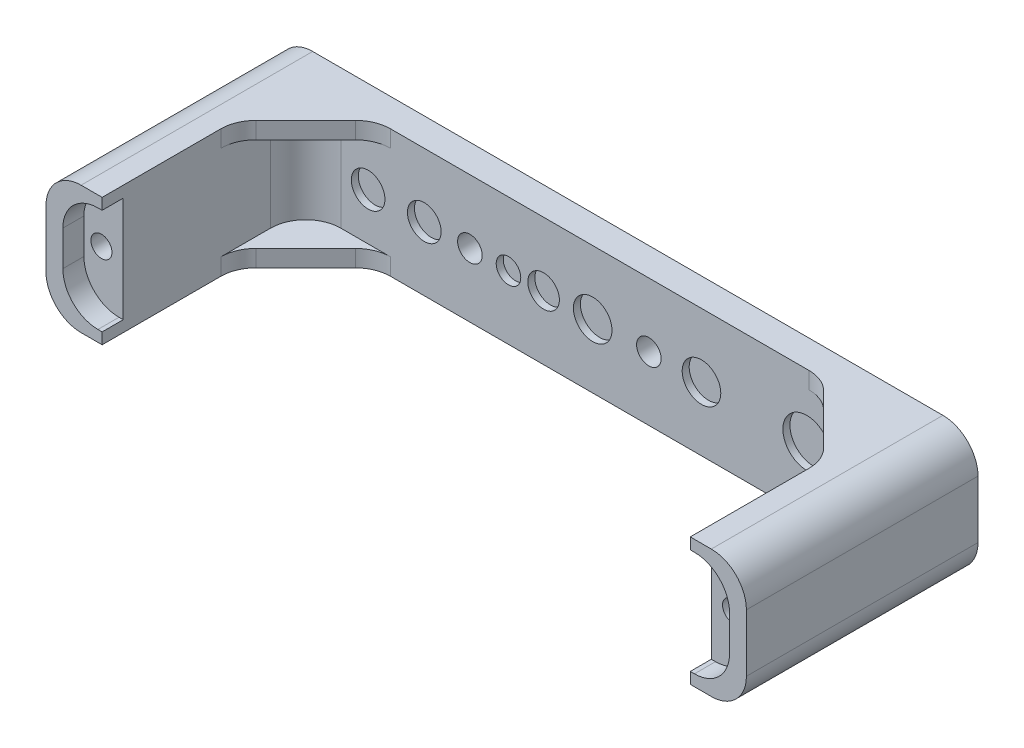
ISO-10303-21;
HEADER;
FILE_DESCRIPTION(('STEP AP214'),'2;1');
FILE_NAME('part.step','',(''),(''),'','','');
FILE_SCHEMA(('AUTOMOTIVE_DESIGN { 1 0 10303 214 1 1 1 1 }'));
ENDSEC;
DATA;
#1=APPLICATION_CONTEXT('core data for automotive mechanical design processes');
#2=APPLICATION_PROTOCOL_DEFINITION('international standard','automotive_design',2000,#1);
#3=PRODUCT_CONTEXT('',#1,'mechanical');
#4=PRODUCT('Part','Part','',(#3));
#5=PRODUCT_RELATED_PRODUCT_CATEGORY('part','',(#4));
#6=PRODUCT_DEFINITION_FORMATION('','',#4);
#7=PRODUCT_DEFINITION_CONTEXT('part definition',#1,'design');
#8=PRODUCT_DEFINITION('design','',#6,#7);
#9=PRODUCT_DEFINITION_SHAPE('','',#8);
#10=(LENGTH_UNIT() NAMED_UNIT(*) SI_UNIT(.MILLI.,.METRE.));
#11=(NAMED_UNIT(*) PLANE_ANGLE_UNIT() SI_UNIT($,.RADIAN.));
#12=(NAMED_UNIT(*) SI_UNIT($,.STERADIAN.) SOLID_ANGLE_UNIT());
#13=UNCERTAINTY_MEASURE_WITH_UNIT(LENGTH_MEASURE(1.E-05),#10,'distance_accuracy_value','');
#14=(GEOMETRIC_REPRESENTATION_CONTEXT(3) GLOBAL_UNCERTAINTY_ASSIGNED_CONTEXT((#13)) GLOBAL_UNIT_ASSIGNED_CONTEXT((#10,
#11,#12)) REPRESENTATION_CONTEXT('',''));
#15=CARTESIAN_POINT('',(0.,0.,0.));
#16=DIRECTION('',(0.,0.,1.));
#17=DIRECTION('',(1.,0.,0.));
#18=AXIS2_PLACEMENT_3D('',#15,#16,#17);
#19=CARTESIAN_POINT('',(-41.9,9.1,-26.));
#20=DIRECTION('',(0.,0.,-1.));
#21=DIRECTION('',(-1.,0.,0.));
#22=AXIS2_PLACEMENT_3D('',#19,#20,#21);
#23=PLANE('',#22);
#24=CARTESIAN_POINT('',(-18.5,0.,-26.));
#25=DIRECTION('',(0.,0.,1.));
#26=DIRECTION('',(1.,0.,0.));
#27=AXIS2_PLACEMENT_3D('',#24,#25,#26);
#28=CIRCLE('',#27,1.75);
#29=CARTESIAN_POINT('',(-16.75,0.,-26.));
#30=VERTEX_POINT('',#29);
#31=EDGE_CURVE('E1425',#30,#30,#28,.T.);
#32=ORIENTED_EDGE('',*,*,#31,.F.);
#33=EDGE_LOOP('',(#32));
#34=FACE_BOUND('',#33,.T.);
#35=CARTESIAN_POINT('',(7.,0.,-26.));
#36=DIRECTION('',(0.,0.,1.));
#37=DIRECTION('',(1.,0.,0.));
#38=AXIS2_PLACEMENT_3D('',#35,#36,#37);
#39=CIRCLE('',#38,1.75);
#40=CARTESIAN_POINT('',(8.75,0.,-26.));
#41=VERTEX_POINT('',#40);
#42=EDGE_CURVE('E1421',#41,#41,#39,.T.);
#43=ORIENTED_EDGE('',*,*,#42,.F.);
#44=EDGE_LOOP('',(#43));
#45=FACE_BOUND('',#44,.T.);
#46=CARTESIAN_POINT('',(29.5,0.,-26.));
#47=DIRECTION('',(0.,0.,1.));
#48=DIRECTION('',(1.,0.,0.));
#49=AXIS2_PLACEMENT_3D('',#46,#47,#48);
#50=CIRCLE('',#49,3.39999999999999);
#51=CARTESIAN_POINT('',(32.9,0.,-26.));
#52=VERTEX_POINT('',#51);
#53=EDGE_CURVE('E1415',#52,#52,#50,.T.);
#54=ORIENTED_EDGE('',*,*,#53,.F.);
#55=EDGE_LOOP('',(#54));
#56=FACE_BOUND('',#55,.T.);
#57=CARTESIAN_POINT('',(14.5,0.,-26.));
#58=DIRECTION('',(0.,0.,1.));
#59=DIRECTION('',(1.,0.,0.));
#60=AXIS2_PLACEMENT_3D('',#57,#58,#59);
#61=CIRCLE('',#60,2.75);
#62=CARTESIAN_POINT('',(17.25,0.,-26.));
#63=VERTEX_POINT('',#62);
#64=EDGE_CURVE('E1409',#63,#63,#61,.T.);
#65=ORIENTED_EDGE('',*,*,#64,.F.);
#66=EDGE_LOOP('',(#65));
#67=FACE_BOUND('',#66,.T.);
#68=CARTESIAN_POINT('',(-1.00000000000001,0.,-26.));
#69=DIRECTION('',(0.,0.,1.));
#70=DIRECTION('',(1.,0.,0.));
#71=AXIS2_PLACEMENT_3D('',#68,#69,#70);
#72=CIRCLE('',#71,2.75);
#73=CARTESIAN_POINT('',(1.74999999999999,0.,-26.));
#74=VERTEX_POINT('',#73);
#75=EDGE_CURVE('E1403',#74,#74,#72,.T.);
#76=ORIENTED_EDGE('',*,*,#75,.F.);
#77=EDGE_LOOP('',(#76));
#78=FACE_BOUND('',#77,.T.);
#79=CARTESIAN_POINT('',(-8.00000000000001,0.,-26.));
#80=DIRECTION('',(0.,0.,1.));
#81=DIRECTION('',(1.,0.,0.));
#82=AXIS2_PLACEMENT_3D('',#79,#80,#81);
#83=CIRCLE('',#82,2.25);
#84=CARTESIAN_POINT('',(-5.75000000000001,0.,-26.));
#85=VERTEX_POINT('',#84);
#86=EDGE_CURVE('E1397',#85,#85,#83,.T.);
#87=ORIENTED_EDGE('',*,*,#86,.F.);
#88=EDGE_LOOP('',(#87));
#89=FACE_BOUND('',#88,.T.);
#90=CARTESIAN_POINT('',(-13.,0.,-26.));
#91=DIRECTION('',(0.,0.,1.));
#92=DIRECTION('',(1.,0.,0.));
#93=AXIS2_PLACEMENT_3D('',#90,#91,#92);
#94=CIRCLE('',#93,1.75);
#95=CARTESIAN_POINT('',(-11.25,0.,-26.));
#96=VERTEX_POINT('',#95);
#97=EDGE_CURVE('E1391',#96,#96,#94,.T.);
#98=ORIENTED_EDGE('',*,*,#97,.F.);
#99=EDGE_LOOP('',(#98));
#100=FACE_BOUND('',#99,.T.);
#101=CARTESIAN_POINT('',(-25.,0.,-26.));
#102=DIRECTION('',(0.,0.,1.));
#103=DIRECTION('',(1.,0.,0.));
#104=AXIS2_PLACEMENT_3D('',#101,#102,#103);
#105=CIRCLE('',#104,2.4);
#106=CARTESIAN_POINT('',(-22.6,0.,-26.));
#107=VERTEX_POINT('',#106);
#108=EDGE_CURVE('E1384',#107,#107,#105,.T.);
#109=ORIENTED_EDGE('',*,*,#108,.F.);
#110=EDGE_LOOP('',(#109));
#111=FACE_BOUND('',#110,.T.);
#112=CARTESIAN_POINT('',(-33.,0.,-26.));
#113=DIRECTION('',(0.,0.,1.));
#114=DIRECTION('',(1.,0.,0.));
#115=AXIS2_PLACEMENT_3D('',#112,#113,#114);
#116=CIRCLE('',#115,2.4);
#117=CARTESIAN_POINT('',(-30.6,0.,-26.));
#118=VERTEX_POINT('',#117);
#119=EDGE_CURVE('E671',#118,#118,#116,.T.);
#120=ORIENTED_EDGE('',*,*,#119,.F.);
#121=EDGE_LOOP('',(#120));
#122=FACE_BOUND('',#121,.T.);
#123=DIRECTION('',(-1.,0.,0.));
#124=VECTOR('',#123,1.);
#125=CARTESIAN_POINT('',(41.9,6.7,-26.));
#126=LINE('',#125,#124);
#127=CARTESIAN_POINT('',(36.9,6.7,-26.));
#128=VERTEX_POINT('',#127);
#129=CARTESIAN_POINT('',(29.8289321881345,6.7,-26.));
#130=VERTEX_POINT('',#129);
#131=EDGE_CURVE('E624',#128,#130,#126,.T.);
#132=ORIENTED_EDGE('',*,*,#131,.T.);
#133=DIRECTION('',(0.,1.,0.));
#134=VECTOR('',#133,1.);
#135=CARTESIAN_POINT('',(29.8289321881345,9.1,-26.));
#136=LINE('',#135,#134);
#137=CARTESIAN_POINT('',(29.8289321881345,9.1,-26.));
#138=VERTEX_POINT('',#137);
#139=EDGE_CURVE('E501',#130,#138,#136,.T.);
#140=ORIENTED_EDGE('',*,*,#139,.T.);
#141=DIRECTION('',(1.,0.,0.));
#142=VECTOR('',#141,1.);
#143=CARTESIAN_POINT('',(-41.9,9.1,-26.));
#144=LINE('',#143,#142);
#145=CARTESIAN_POINT('',(-29.8289321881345,9.1,-26.));
#146=VERTEX_POINT('',#145);
#147=EDGE_CURVE('E347',#146,#138,#144,.T.);
#148=ORIENTED_EDGE('',*,*,#147,.F.);
#149=DIRECTION('',(0.,1.,0.));
#150=VECTOR('',#149,1.);
#151=CARTESIAN_POINT('',(-29.8289321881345,6.7,-26.));
#152=LINE('',#151,#150);
#153=CARTESIAN_POINT('',(-29.8289321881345,6.7,-26.));
#154=VERTEX_POINT('',#153);
#155=EDGE_CURVE('E495',#146,#154,#152,.F.);
#156=ORIENTED_EDGE('',*,*,#155,.T.);
#157=DIRECTION('',(1.,0.,0.));
#158=VECTOR('',#157,1.);
#159=CARTESIAN_POINT('',(-41.9,6.7,-26.));
#160=LINE('',#159,#158);
#161=CARTESIAN_POINT('',(-36.9,6.7,-26.));
#162=VERTEX_POINT('',#161);
#163=EDGE_CURVE('E625',#162,#154,#160,.T.);
#164=ORIENTED_EDGE('',*,*,#163,.F.);
#165=DIRECTION('',(0.,-1.,0.));
#166=VECTOR('',#165,1.);
#167=CARTESIAN_POINT('',(-36.9,-6.7,-26.));
#168=LINE('',#167,#166);
#169=CARTESIAN_POINT('',(-36.9,-6.7,-26.));
#170=VERTEX_POINT('',#169);
#171=EDGE_CURVE('E487',#162,#170,#168,.T.);
#172=ORIENTED_EDGE('',*,*,#171,.T.);
#173=DIRECTION('',(1.,0.,0.));
#174=VECTOR('',#173,1.);
#175=CARTESIAN_POINT('',(-41.9,-6.7,-26.));
#176=LINE('',#175,#174);
#177=CARTESIAN_POINT('',(-29.8289321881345,-6.7,-26.));
#178=VERTEX_POINT('',#177);
#179=EDGE_CURVE('E342',#170,#178,#176,.T.);
#180=ORIENTED_EDGE('',*,*,#179,.T.);
#181=DIRECTION('',(0.,-1.,0.));
#182=VECTOR('',#181,1.);
#183=CARTESIAN_POINT('',(-29.8289321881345,9.1,-26.));
#184=LINE('',#183,#182);
#185=CARTESIAN_POINT('',(-29.8289321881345,-9.1,-26.));
#186=VERTEX_POINT('',#185);
#187=EDGE_CURVE('E492',#178,#186,#184,.T.);
#188=ORIENTED_EDGE('',*,*,#187,.T.);
#189=DIRECTION('',(1.,0.,0.));
#190=VECTOR('',#189,1.);
#191=CARTESIAN_POINT('',(-41.9,-9.1,-26.));
#192=LINE('',#191,#190);
#193=CARTESIAN_POINT('',(29.8289321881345,-9.1,-26.));
#194=VERTEX_POINT('',#193);
#195=EDGE_CURVE('E336',#186,#194,#192,.T.);
#196=ORIENTED_EDGE('',*,*,#195,.T.);
#197=DIRECTION('',(0.,-1.,0.));
#198=VECTOR('',#197,1.);
#199=CARTESIAN_POINT('',(29.8289321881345,-6.7,-26.));
#200=LINE('',#199,#198);
#201=CARTESIAN_POINT('',(29.8289321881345,-6.7,-26.));
#202=VERTEX_POINT('',#201);
#203=EDGE_CURVE('E498',#194,#202,#200,.F.);
#204=ORIENTED_EDGE('',*,*,#203,.T.);
#205=DIRECTION('',(-1.,0.,0.));
#206=VECTOR('',#205,1.);
#207=CARTESIAN_POINT('',(41.9,-6.7,-26.));
#208=LINE('',#207,#206);
#209=CARTESIAN_POINT('',(36.9,-6.7,-26.));
#210=VERTEX_POINT('',#209);
#211=EDGE_CURVE('E659',#210,#202,#208,.T.);
#212=ORIENTED_EDGE('',*,*,#211,.F.);
#213=DIRECTION('',(0.,-1.,0.));
#214=VECTOR('',#213,1.);
#215=CARTESIAN_POINT('',(36.9,6.7,-26.));
#216=LINE('',#215,#214);
#217=EDGE_CURVE('E490',#210,#128,#216,.F.);
#218=ORIENTED_EDGE('',*,*,#217,.T.);
#219=EDGE_LOOP('',(#132,#140,#148,#156,#164,#172,#180,#188,#196,#204,#212,#218));
#220=FACE_BOUND('',#219,.T.);
#221=ADVANCED_FACE('F36',(#34,#45,#56,#67,#78,#89,#100,#111,#122,#220),#23,.F.);
#222=CARTESIAN_POINT('',(41.9,9.1,-26.));
#223=DIRECTION('',(1.,0.,0.));
#224=DIRECTION('',(0.,1.,0.));
#225=AXIS2_PLACEMENT_3D('',#222,#223,#224);
#226=PLANE('',#225);
#227=DIRECTION('',(0.,0.,1.));
#228=VECTOR('',#227,1.);
#229=CARTESIAN_POINT('',(41.9,9.1,-26.));
#230=LINE('',#229,#228);
#231=CARTESIAN_POINT('',(41.9,9.1,-13.9289321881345));
#232=VERTEX_POINT('',#231);
#233=CARTESIAN_POINT('',(41.9,9.1,3.));
#234=VERTEX_POINT('',#233);
#235=EDGE_CURVE('E340',#232,#234,#230,.T.);
#236=ORIENTED_EDGE('',*,*,#235,.F.);
#237=DIRECTION('',(0.,1.,0.));
#238=VECTOR('',#237,1.);
#239=CARTESIAN_POINT('',(41.9,9.1,-13.9289321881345));
#240=LINE('',#239,#238);
#241=CARTESIAN_POINT('',(41.9,6.7,-13.9289321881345));
#242=VERTEX_POINT('',#241);
#243=EDGE_CURVE('E515',#232,#242,#240,.F.);
#244=ORIENTED_EDGE('',*,*,#243,.T.);
#245=DIRECTION('',(0.,0.,-1.));
#246=VECTOR('',#245,1.);
#247=CARTESIAN_POINT('',(41.9,6.7,-16.));
#248=LINE('',#247,#246);
#249=CARTESIAN_POINT('',(41.9,6.7,-21.));
#250=VERTEX_POINT('',#249);
#251=EDGE_CURVE('E627',#242,#250,#248,.T.);
#252=ORIENTED_EDGE('',*,*,#251,.T.);
#253=DIRECTION('',(0.,-1.,0.));
#254=VECTOR('',#253,1.);
#255=CARTESIAN_POINT('',(41.9,-6.7,-21.));
#256=LINE('',#255,#254);
#257=CARTESIAN_POINT('',(41.9,-6.7,-21.));
#258=VERTEX_POINT('',#257);
#259=EDGE_CURVE('E509',#250,#258,#256,.T.);
#260=ORIENTED_EDGE('',*,*,#259,.T.);
#261=DIRECTION('',(0.,0.,-1.));
#262=VECTOR('',#261,1.);
#263=CARTESIAN_POINT('',(41.9,-6.7,-16.));
#264=LINE('',#263,#262);
#265=CARTESIAN_POINT('',(41.9,-6.7,-13.9289321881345));
#266=VERTEX_POINT('',#265);
#267=EDGE_CURVE('E636',#266,#258,#264,.T.);
#268=ORIENTED_EDGE('',*,*,#267,.F.);
#269=DIRECTION('',(0.,-1.,0.));
#270=VECTOR('',#269,1.);
#271=CARTESIAN_POINT('',(41.9,-9.1,-13.9289321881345));
#272=LINE('',#271,#270);
#273=CARTESIAN_POINT('',(41.9,-9.1,-13.9289321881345));
#274=VERTEX_POINT('',#273);
#275=EDGE_CURVE('E512',#266,#274,#272,.T.);
#276=ORIENTED_EDGE('',*,*,#275,.T.);
#277=DIRECTION('',(0.,0.,1.));
#278=VECTOR('',#277,1.);
#279=CARTESIAN_POINT('',(41.9,-9.1,-26.));
#280=LINE('',#279,#278);
#281=CARTESIAN_POINT('',(41.9,-9.1,3.));
#282=VERTEX_POINT('',#281);
#283=EDGE_CURVE('E337',#274,#282,#280,.T.);
#284=ORIENTED_EDGE('',*,*,#283,.T.);
#285=DIRECTION('',(0.,1.,0.));
#286=VECTOR('',#285,1.);
#287=CARTESIAN_POINT('',(41.9,0.,3.));
#288=LINE('',#287,#286);
#289=CARTESIAN_POINT('',(41.9,-7.5,3.));
#290=VERTEX_POINT('',#289);
#291=EDGE_CURVE('E356',#282,#290,#288,.T.);
#292=ORIENTED_EDGE('',*,*,#291,.T.);
#293=DIRECTION('',(0.,0.,-1.));
#294=VECTOR('',#293,1.);
#295=CARTESIAN_POINT('',(41.9,-7.5,3.));
#296=LINE('',#295,#294);
#297=CARTESIAN_POINT('',(41.9,-7.5,0.));
#298=VERTEX_POINT('',#297);
#299=EDGE_CURVE('E349',#290,#298,#296,.T.);
#300=ORIENTED_EDGE('',*,*,#299,.T.);
#301=DIRECTION('',(0.,-1.,0.));
#302=VECTOR('',#301,1.);
#303=CARTESIAN_POINT('',(41.9,0.,0.));
#304=LINE('',#303,#302);
#305=CARTESIAN_POINT('',(41.9,7.5,0.));
#306=VERTEX_POINT('',#305);
#307=EDGE_CURVE('E449',#306,#298,#304,.T.);
#308=ORIENTED_EDGE('',*,*,#307,.F.);
#309=DIRECTION('',(0.,0.,1.));
#310=VECTOR('',#309,1.);
#311=CARTESIAN_POINT('',(41.9,7.5,3.));
#312=LINE('',#311,#310);
#313=CARTESIAN_POINT('',(41.9,7.5,3.));
#314=VERTEX_POINT('',#313);
#315=EDGE_CURVE('E351',#306,#314,#312,.T.);
#316=ORIENTED_EDGE('',*,*,#315,.T.);
#317=EDGE_CURVE('E353',#314,#234,#288,.T.);
#318=ORIENTED_EDGE('',*,*,#317,.T.);
#319=EDGE_LOOP('',(#236,#244,#252,#260,#268,#276,#284,#292,#300,#308,#316,#318));
#320=FACE_BOUND('',#319,.T.);
#321=ADVANCED_FACE('F688',(#320),#226,.F.);
#322=CARTESIAN_POINT('',(-41.9,9.1,-26.));
#323=DIRECTION('',(-1.,0.,0.));
#324=DIRECTION('',(0.,-1.,0.));
#325=AXIS2_PLACEMENT_3D('',#322,#323,#324);
#326=PLANE('',#325);
#327=DIRECTION('',(0.,0.,-1.));
#328=VECTOR('',#327,1.);
#329=CARTESIAN_POINT('',(-41.9,-9.1,-26.));
#330=LINE('',#329,#328);
#331=CARTESIAN_POINT('',(-41.9,-9.1,3.));
#332=VERTEX_POINT('',#331);
#333=CARTESIAN_POINT('',(-41.9,-9.1,-13.9289321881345));
#334=VERTEX_POINT('',#333);
#335=EDGE_CURVE('E325',#332,#334,#330,.T.);
#336=ORIENTED_EDGE('',*,*,#335,.T.);
#337=DIRECTION('',(0.,-1.,0.));
#338=VECTOR('',#337,1.);
#339=CARTESIAN_POINT('',(-41.9,9.1,-13.9289321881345));
#340=LINE('',#339,#338);
#341=CARTESIAN_POINT('',(-41.9,-6.7,-13.9289321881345));
#342=VERTEX_POINT('',#341);
#343=EDGE_CURVE('E533',#334,#342,#340,.F.);
#344=ORIENTED_EDGE('',*,*,#343,.T.);
#345=DIRECTION('',(0.,0.,-1.));
#346=VECTOR('',#345,1.);
#347=CARTESIAN_POINT('',(-41.9,-6.7,-16.));
#348=LINE('',#347,#346);
#349=CARTESIAN_POINT('',(-41.9,-6.7,-21.));
#350=VERTEX_POINT('',#349);
#351=EDGE_CURVE('E595',#342,#350,#348,.T.);
#352=ORIENTED_EDGE('',*,*,#351,.T.);
#353=DIRECTION('',(0.,-1.,0.));
#354=VECTOR('',#353,1.);
#355=CARTESIAN_POINT('',(-41.9,6.7,-21.));
#356=LINE('',#355,#354);
#357=CARTESIAN_POINT('',(-41.9,6.7,-21.));
#358=VERTEX_POINT('',#357);
#359=EDGE_CURVE('E528',#350,#358,#356,.F.);
#360=ORIENTED_EDGE('',*,*,#359,.T.);
#361=DIRECTION('',(0.,0.,-1.));
#362=VECTOR('',#361,1.);
#363=CARTESIAN_POINT('',(-41.9,6.7,-16.));
#364=LINE('',#363,#362);
#365=CARTESIAN_POINT('',(-41.9,6.7,-13.9289321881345));
#366=VERTEX_POINT('',#365);
#367=EDGE_CURVE('E587',#366,#358,#364,.T.);
#368=ORIENTED_EDGE('',*,*,#367,.F.);
#369=DIRECTION('',(0.,1.,0.));
#370=VECTOR('',#369,1.);
#371=CARTESIAN_POINT('',(-41.9,9.1,-13.9289321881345));
#372=LINE('',#371,#370);
#373=CARTESIAN_POINT('',(-41.9,9.1,-13.9289321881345));
#374=VERTEX_POINT('',#373);
#375=EDGE_CURVE('E530',#366,#374,#372,.T.);
#376=ORIENTED_EDGE('',*,*,#375,.T.);
#377=DIRECTION('',(0.,0.,-1.));
#378=VECTOR('',#377,1.);
#379=CARTESIAN_POINT('',(-41.9,9.1,-26.));
#380=LINE('',#379,#378);
#381=CARTESIAN_POINT('',(-41.9,9.1,3.));
#382=VERTEX_POINT('',#381);
#383=EDGE_CURVE('E605',#382,#374,#380,.T.);
#384=ORIENTED_EDGE('',*,*,#383,.F.);
#385=DIRECTION('',(0.,-1.,0.));
#386=VECTOR('',#385,1.);
#387=CARTESIAN_POINT('',(-41.9,0.,3.));
#388=LINE('',#387,#386);
#389=CARTESIAN_POINT('',(-41.9,7.5,3.));
#390=VERTEX_POINT('',#389);
#391=EDGE_CURVE('E329',#382,#390,#388,.T.);
#392=ORIENTED_EDGE('',*,*,#391,.T.);
#393=DIRECTION('',(0.,0.,-1.));
#394=VECTOR('',#393,1.);
#395=CARTESIAN_POINT('',(-41.9,7.5,3.));
#396=LINE('',#395,#394);
#397=CARTESIAN_POINT('',(-41.9,7.5,0.));
#398=VERTEX_POINT('',#397);
#399=EDGE_CURVE('E330',#390,#398,#396,.T.);
#400=ORIENTED_EDGE('',*,*,#399,.T.);
#401=DIRECTION('',(0.,1.,0.));
#402=VECTOR('',#401,1.);
#403=CARTESIAN_POINT('',(-41.9,0.,0.));
#404=LINE('',#403,#402);
#405=CARTESIAN_POINT('',(-41.9,-7.5,0.));
#406=VERTEX_POINT('',#405);
#407=EDGE_CURVE('E446',#406,#398,#404,.T.);
#408=ORIENTED_EDGE('',*,*,#407,.F.);
#409=DIRECTION('',(0.,0.,1.));
#410=VECTOR('',#409,1.);
#411=CARTESIAN_POINT('',(-41.9,-7.5,3.));
#412=LINE('',#411,#410);
#413=CARTESIAN_POINT('',(-41.9,-7.5,3.));
#414=VERTEX_POINT('',#413);
#415=EDGE_CURVE('E328',#406,#414,#412,.T.);
#416=ORIENTED_EDGE('',*,*,#415,.T.);
#417=EDGE_CURVE('E311',#414,#332,#388,.T.);
#418=ORIENTED_EDGE('',*,*,#417,.T.);
#419=EDGE_LOOP('',(#336,#344,#352,#360,#368,#376,#384,#392,#400,#408,#416,#418));
#420=FACE_BOUND('',#419,.T.);
#421=ADVANCED_FACE('F323',(#420),#326,.F.);
#422=CARTESIAN_POINT('',(0.,7.5,3.));
#423=DIRECTION('',(0.,-1.,0.));
#424=DIRECTION('',(0.,0.,-1.));
#425=AXIS2_PLACEMENT_3D('',#422,#423,#424);
#426=PLANE('',#425);
#427=ORIENTED_EDGE('',*,*,#315,.F.);
#428=DIRECTION('',(-1.,0.,0.));
#429=VECTOR('',#428,1.);
#430=CARTESIAN_POINT('',(0.,7.5,0.));
#431=LINE('',#430,#429);
#432=CARTESIAN_POINT('',(42.5,7.5,0.));
#433=VERTEX_POINT('',#432);
#434=EDGE_CURVE('E396',#433,#306,#431,.T.);
#435=ORIENTED_EDGE('',*,*,#434,.F.);
#436=DIRECTION('',(0.,0.,-1.));
#437=VECTOR('',#436,1.);
#438=CARTESIAN_POINT('',(42.5,7.5,3.));
#439=LINE('',#438,#437);
#440=CARTESIAN_POINT('',(42.5,7.5,3.));
#441=VERTEX_POINT('',#440);
#442=EDGE_CURVE('E430',#441,#433,#439,.T.);
#443=ORIENTED_EDGE('',*,*,#442,.F.);
#444=DIRECTION('',(-1.,0.,0.));
#445=VECTOR('',#444,1.);
#446=CARTESIAN_POINT('',(0.,7.5,3.));
#447=LINE('',#446,#445);
#448=EDGE_CURVE('E362',#441,#314,#447,.T.);
#449=ORIENTED_EDGE('',*,*,#448,.T.);
#450=EDGE_LOOP('',(#427,#435,#443,#449));
#451=FACE_BOUND('',#450,.T.);
#452=ADVANCED_FACE('F697',(#451),#426,.T.);
#453=CARTESIAN_POINT('',(0.,-7.5,3.));
#454=DIRECTION('',(0.,1.,0.));
#455=DIRECTION('',(-1.,0.,0.));
#456=AXIS2_PLACEMENT_3D('',#453,#454,#455);
#457=PLANE('',#456);
#458=ORIENTED_EDGE('',*,*,#299,.F.);
#459=DIRECTION('',(1.,0.,0.));
#460=VECTOR('',#459,1.);
#461=CARTESIAN_POINT('',(0.,-7.5,3.));
#462=LINE('',#461,#460);
#463=CARTESIAN_POINT('',(42.5,-7.5,3.));
#464=VERTEX_POINT('',#463);
#465=EDGE_CURVE('E374',#290,#464,#462,.T.);
#466=ORIENTED_EDGE('',*,*,#465,.T.);
#467=DIRECTION('',(0.,0.,-1.));
#468=VECTOR('',#467,1.);
#469=CARTESIAN_POINT('',(42.5,-7.5,3.));
#470=LINE('',#469,#468);
#471=CARTESIAN_POINT('',(42.5,-7.5,0.));
#472=VERTEX_POINT('',#471);
#473=EDGE_CURVE('E423',#464,#472,#470,.T.);
#474=ORIENTED_EDGE('',*,*,#473,.T.);
#475=DIRECTION('',(1.,0.,0.));
#476=VECTOR('',#475,1.);
#477=CARTESIAN_POINT('',(0.,-7.5,0.));
#478=LINE('',#477,#476);
#479=EDGE_CURVE('E408',#298,#472,#478,.T.);
#480=ORIENTED_EDGE('',*,*,#479,.F.);
#481=EDGE_LOOP('',(#458,#466,#474,#480));
#482=FACE_BOUND('',#481,.T.);
#483=ADVANCED_FACE('F716',(#482),#457,.T.);
#484=CARTESIAN_POINT('',(0.,0.,3.));
#485=DIRECTION('',(0.,0.,1.));
#486=DIRECTION('',(1.,0.,0.));
#487=AXIS2_PLACEMENT_3D('',#484,#485,#486);
#488=PLANE('',#487);
#489=DIRECTION('',(1.,0.,0.));
#490=VECTOR('',#489,1.);
#491=CARTESIAN_POINT('',(0.,-9.1,3.));
#492=LINE('',#491,#490);
#493=CARTESIAN_POINT('',(44.9,-9.1,3.));
#494=VERTEX_POINT('',#493);
#495=EDGE_CURVE('E319',#282,#494,#492,.T.);
#496=ORIENTED_EDGE('',*,*,#495,.T.);
#497=CARTESIAN_POINT('',(44.9,-4.1,3.));
#498=DIRECTION('',(0.,0.,1.));
#499=DIRECTION('',(1.,0.,0.));
#500=AXIS2_PLACEMENT_3D('',#497,#498,#499);
#501=CIRCLE('',#500,5.);
#502=CARTESIAN_POINT('',(49.9,-4.1,3.));
#503=VERTEX_POINT('',#502);
#504=EDGE_CURVE('E459',#494,#503,#501,.T.);
#505=ORIENTED_EDGE('',*,*,#504,.T.);
#506=DIRECTION('',(0.,1.,0.));
#507=VECTOR('',#506,1.);
#508=CARTESIAN_POINT('',(49.9,0.,3.));
#509=LINE('',#508,#507);
#510=CARTESIAN_POINT('',(49.9,4.1,3.));
#511=VERTEX_POINT('',#510);
#512=EDGE_CURVE('E318',#503,#511,#509,.T.);
#513=ORIENTED_EDGE('',*,*,#512,.T.);
#514=CARTESIAN_POINT('',(44.9,4.1,3.));
#515=DIRECTION('',(0.,0.,1.));
#516=DIRECTION('',(1.,0.,0.));
#517=AXIS2_PLACEMENT_3D('',#514,#515,#516);
#518=CIRCLE('',#517,5.);
#519=CARTESIAN_POINT('',(44.9,9.1,3.));
#520=VERTEX_POINT('',#519);
#521=EDGE_CURVE('E457',#511,#520,#518,.T.);
#522=ORIENTED_EDGE('',*,*,#521,.T.);
#523=DIRECTION('',(-1.,0.,0.));
#524=VECTOR('',#523,1.);
#525=CARTESIAN_POINT('',(0.,9.1,3.));
#526=LINE('',#525,#524);
#527=EDGE_CURVE('E386',#520,#234,#526,.T.);
#528=ORIENTED_EDGE('',*,*,#527,.T.);
#529=ORIENTED_EDGE('',*,*,#317,.F.);
#530=ORIENTED_EDGE('',*,*,#448,.F.);
#531=CARTESIAN_POINT('',(42.5,2.5,3.));
#532=DIRECTION('',(0.,0.,1.));
#533=DIRECTION('',(1.,0.,0.));
#534=AXIS2_PLACEMENT_3D('',#531,#532,#533);
#535=CIRCLE('',#534,5.);
#536=CARTESIAN_POINT('',(47.5,2.49999999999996,3.));
#537=VERTEX_POINT('',#536);
#538=EDGE_CURVE('E365',#537,#441,#535,.T.);
#539=ORIENTED_EDGE('',*,*,#538,.F.);
#540=DIRECTION('',(0.,1.,0.));
#541=VECTOR('',#540,1.);
#542=CARTESIAN_POINT('',(47.5,0.,3.));
#543=LINE('',#542,#541);
#544=CARTESIAN_POINT('',(47.5,-2.49999999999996,3.));
#545=VERTEX_POINT('',#544);
#546=EDGE_CURVE('E368',#545,#537,#543,.T.);
#547=ORIENTED_EDGE('',*,*,#546,.F.);
#548=CARTESIAN_POINT('',(42.5,-2.5,3.));
#549=DIRECTION('',(0.,0.,1.));
#550=DIRECTION('',(1.,0.,0.));
#551=AXIS2_PLACEMENT_3D('',#548,#549,#550);
#552=CIRCLE('',#551,5.);
#553=EDGE_CURVE('E371',#464,#545,#552,.T.);
#554=ORIENTED_EDGE('',*,*,#553,.F.);
#555=ORIENTED_EDGE('',*,*,#465,.F.);
#556=ORIENTED_EDGE('',*,*,#291,.F.);
#557=EDGE_LOOP('',(#496,#505,#513,#522,#528,#529,#530,#539,#547,#554,#555,#556));
#558=FACE_BOUND('',#557,.T.);
#559=ADVANCED_FACE('F694',(#558),#488,.T.);
#560=CARTESIAN_POINT('',(0.,0.,0.));
#561=DIRECTION('',(0.,0.,-1.));
#562=DIRECTION('',(-1.,0.,0.));
#563=AXIS2_PLACEMENT_3D('',#560,#561,#562);
#564=PLANE('',#563);
#565=CARTESIAN_POINT('',(45.,0.,0.));
#566=DIRECTION('',(0.,0.,1.));
#567=DIRECTION('',(1.,0.,0.));
#568=AXIS2_PLACEMENT_3D('',#565,#566,#567);
#569=CIRCLE('',#568,1.49999999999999);
#570=CARTESIAN_POINT('',(46.5,0.,0.));
#571=VERTEX_POINT('',#570);
#572=EDGE_CURVE('E1429',#571,#571,#569,.T.);
#573=ORIENTED_EDGE('',*,*,#572,.F.);
#574=EDGE_LOOP('',(#573));
#575=FACE_BOUND('',#574,.T.);
#576=ORIENTED_EDGE('',*,*,#434,.T.);
#577=ORIENTED_EDGE('',*,*,#307,.T.);
#578=ORIENTED_EDGE('',*,*,#479,.T.);
#579=CARTESIAN_POINT('',(42.5,-2.5,0.));
#580=DIRECTION('',(0.,0.,1.));
#581=DIRECTION('',(1.,0.,0.));
#582=AXIS2_PLACEMENT_3D('',#579,#580,#581);
#583=CIRCLE('',#582,5.);
#584=CARTESIAN_POINT('',(47.5,-2.49999999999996,0.));
#585=VERTEX_POINT('',#584);
#586=EDGE_CURVE('E405',#472,#585,#583,.T.);
#587=ORIENTED_EDGE('',*,*,#586,.T.);
#588=DIRECTION('',(0.,1.,0.));
#589=VECTOR('',#588,1.);
#590=CARTESIAN_POINT('',(47.5,0.,0.));
#591=LINE('',#590,#589);
#592=CARTESIAN_POINT('',(47.5,2.49999999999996,0.));
#593=VERTEX_POINT('',#592);
#594=EDGE_CURVE('E402',#585,#593,#591,.T.);
#595=ORIENTED_EDGE('',*,*,#594,.T.);
#596=CARTESIAN_POINT('',(42.5,2.5,0.));
#597=DIRECTION('',(0.,0.,1.));
#598=DIRECTION('',(1.,0.,0.));
#599=AXIS2_PLACEMENT_3D('',#596,#597,#598);
#600=CIRCLE('',#599,5.);
#601=EDGE_CURVE('E399',#593,#433,#600,.T.);
#602=ORIENTED_EDGE('',*,*,#601,.T.);
#603=EDGE_LOOP('',(#576,#577,#578,#587,#595,#602));
#604=FACE_BOUND('',#603,.T.);
#605=ADVANCED_FACE('F719',(#575,#604),#564,.F.);
#606=CARTESIAN_POINT('',(49.9,-9.1,-30.));
#607=DIRECTION('',(1.,0.,0.));
#608=DIRECTION('',(0.,0.,-1.));
#609=AXIS2_PLACEMENT_3D('',#606,#607,#608);
#610=PLANE('',#609);
#611=ORIENTED_EDGE('',*,*,#512,.F.);
#612=DIRECTION('',(0.,0.,1.));
#613=VECTOR('',#612,1.);
#614=CARTESIAN_POINT('',(49.9,-4.1,-30.));
#615=LINE('',#614,#613);
#616=CARTESIAN_POINT('',(49.9,-4.1,-30.));
#617=VERTEX_POINT('',#616);
#618=EDGE_CURVE('E464',#503,#617,#615,.F.);
#619=ORIENTED_EDGE('',*,*,#618,.T.);
#620=DIRECTION('',(0.,1.,0.));
#621=VECTOR('',#620,1.);
#622=CARTESIAN_POINT('',(49.9,-9.1,-30.));
#623=LINE('',#622,#621);
#624=CARTESIAN_POINT('',(49.9,4.1,-30.));
#625=VERTEX_POINT('',#624);
#626=EDGE_CURVE('E435',#617,#625,#623,.T.);
#627=ORIENTED_EDGE('',*,*,#626,.T.);
#628=DIRECTION('',(0.,0.,1.));
#629=VECTOR('',#628,1.);
#630=CARTESIAN_POINT('',(49.9,4.1,-30.));
#631=LINE('',#630,#629);
#632=EDGE_CURVE('E461',#625,#511,#631,.T.);
#633=ORIENTED_EDGE('',*,*,#632,.T.);
#634=EDGE_LOOP('',(#611,#619,#627,#633));
#635=FACE_BOUND('',#634,.T.);
#636=ADVANCED_FACE('F721',(#635),#610,.T.);
#637=CARTESIAN_POINT('',(-49.9,-9.1,-30.));
#638=DIRECTION('',(0.,-1.,0.));
#639=DIRECTION('',(1.,0.,0.));
#640=AXIS2_PLACEMENT_3D('',#637,#638,#639);
#641=PLANE('',#640);
#642=DIRECTION('',(1.,0.,0.));
#643=VECTOR('',#642,1.);
#644=CARTESIAN_POINT('',(-49.9,-9.1,-30.));
#645=LINE('',#644,#643);
#646=CARTESIAN_POINT('',(-44.9,-9.1,-30.));
#647=VERTEX_POINT('',#646);
#648=CARTESIAN_POINT('',(44.9,-9.1,-30.));
#649=VERTEX_POINT('',#648);
#650=EDGE_CURVE('E444',#647,#649,#645,.T.);
#651=ORIENTED_EDGE('',*,*,#650,.T.);
#652=DIRECTION('',(0.,0.,1.));
#653=VECTOR('',#652,1.);
#654=CARTESIAN_POINT('',(44.9,-9.1,-30.));
#655=LINE('',#654,#653);
#656=EDGE_CURVE('E454',#649,#494,#655,.T.);
#657=ORIENTED_EDGE('',*,*,#656,.T.);
#658=ORIENTED_EDGE('',*,*,#495,.F.);
#659=ORIENTED_EDGE('',*,*,#283,.F.);
#660=CARTESIAN_POINT('',(36.9,-9.1,-13.9289321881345));
#661=DIRECTION('',(0.,-1.,0.));
#662=DIRECTION('',(1.,0.,0.));
#663=AXIS2_PLACEMENT_3D('',#660,#661,#662);
#664=CIRCLE('',#663,5.);
#665=CARTESIAN_POINT('',(40.4355339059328,-9.1,-17.4644660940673));
#666=VERTEX_POINT('',#665);
#667=EDGE_CURVE('E556',#274,#666,#664,.F.);
#668=ORIENTED_EDGE('',*,*,#667,.T.);
#669=DIRECTION('',(0.707106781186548,0.,0.707106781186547));
#670=VECTOR('',#669,1.);
#671=CARTESIAN_POINT('',(31.9,-9.1,-26.));
#672=LINE('',#671,#670);
#673=CARTESIAN_POINT('',(33.3644660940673,-9.1,-24.5355339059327));
#674=VERTEX_POINT('',#673);
#675=EDGE_CURVE('E665',#674,#666,#672,.T.);
#676=ORIENTED_EDGE('',*,*,#675,.F.);
#677=CARTESIAN_POINT('',(29.8289321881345,-9.1,-21.));
#678=DIRECTION('',(0.,-1.,0.));
#679=DIRECTION('',(1.,0.,0.));
#680=AXIS2_PLACEMENT_3D('',#677,#678,#679);
#681=CIRCLE('',#680,5.);
#682=EDGE_CURVE('E561',#674,#194,#681,.F.);
#683=ORIENTED_EDGE('',*,*,#682,.T.);
#684=ORIENTED_EDGE('',*,*,#195,.F.);
#685=CARTESIAN_POINT('',(-29.8289321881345,-9.1,-21.));
#686=DIRECTION('',(0.,-1.,0.));
#687=DIRECTION('',(1.,0.,0.));
#688=AXIS2_PLACEMENT_3D('',#685,#686,#687);
#689=CIRCLE('',#688,5.);
#690=CARTESIAN_POINT('',(-33.3644660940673,-9.1,-24.5355339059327));
#691=VERTEX_POINT('',#690);
#692=EDGE_CURVE('E44',#186,#691,#689,.F.);
#693=ORIENTED_EDGE('',*,*,#692,.T.);
#694=DIRECTION('',(-0.707106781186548,0.,0.707106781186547));
#695=VECTOR('',#694,1.);
#696=CARTESIAN_POINT('',(-31.9,-9.1,-26.));
#697=LINE('',#696,#695);
#698=CARTESIAN_POINT('',(-40.4355339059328,-9.1,-17.4644660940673));
#699=VERTEX_POINT('',#698);
#700=EDGE_CURVE('E577',#691,#699,#697,.T.);
#701=ORIENTED_EDGE('',*,*,#700,.T.);
#702=CARTESIAN_POINT('',(-36.9,-9.1,-13.9289321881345));
#703=DIRECTION('',(0.,-1.,0.));
#704=DIRECTION('',(1.,0.,0.));
#705=AXIS2_PLACEMENT_3D('',#702,#703,#704);
#706=CIRCLE('',#705,5.);
#707=EDGE_CURVE('E335',#699,#334,#706,.F.);
#708=ORIENTED_EDGE('',*,*,#707,.T.);
#709=ORIENTED_EDGE('',*,*,#335,.F.);
#710=CARTESIAN_POINT('',(-44.9,-9.1,3.));
#711=VERTEX_POINT('',#710);
#712=EDGE_CURVE('E306',#711,#332,#492,.T.);
#713=ORIENTED_EDGE('',*,*,#712,.F.);
#714=DIRECTION('',(0.,0.,1.));
#715=VECTOR('',#714,1.);
#716=CARTESIAN_POINT('',(-44.9,-9.1,-30.));
#717=LINE('',#716,#715);
#718=EDGE_CURVE('E452',#711,#647,#717,.F.);
#719=ORIENTED_EDGE('',*,*,#718,.T.);
#720=EDGE_LOOP('',(#651,#657,#658,#659,#668,#676,#683,#684,#693,#701,#708,#709,#713,#719));
#721=FACE_BOUND('',#720,.T.);
#722=ADVANCED_FACE('F333',(#721),#641,.T.);
#723=CARTESIAN_POINT('',(-49.9,-9.1,-30.));
#724=DIRECTION('',(-1.,0.,0.));
#725=DIRECTION('',(0.,0.,1.));
#726=AXIS2_PLACEMENT_3D('',#723,#724,#725);
#727=PLANE('',#726);
#728=DIRECTION('',(0.,-1.,0.));
#729=VECTOR('',#728,1.);
#730=CARTESIAN_POINT('',(-49.9,0.,3.));
#731=LINE('',#730,#729);
#732=CARTESIAN_POINT('',(-49.9,4.1,3.));
#733=VERTEX_POINT('',#732);
#734=CARTESIAN_POINT('',(-49.9,-4.1,3.));
#735=VERTEX_POINT('',#734);
#736=EDGE_CURVE('E389',#733,#735,#731,.T.);
#737=ORIENTED_EDGE('',*,*,#736,.F.);
#738=DIRECTION('',(0.,0.,1.));
#739=VECTOR('',#738,1.);
#740=CARTESIAN_POINT('',(-49.9,4.1,-30.));
#741=LINE('',#740,#739);
#742=CARTESIAN_POINT('',(-49.9,4.1,-30.));
#743=VERTEX_POINT('',#742);
#744=EDGE_CURVE('E485',#733,#743,#741,.F.);
#745=ORIENTED_EDGE('',*,*,#744,.T.);
#746=DIRECTION('',(0.,-1.,0.));
#747=VECTOR('',#746,1.);
#748=CARTESIAN_POINT('',(-49.9,-9.1,-30.));
#749=LINE('',#748,#747);
#750=CARTESIAN_POINT('',(-49.9,-4.1,-30.));
#751=VERTEX_POINT('',#750);
#752=EDGE_CURVE('E441',#743,#751,#749,.T.);
#753=ORIENTED_EDGE('',*,*,#752,.T.);
#754=DIRECTION('',(0.,0.,1.));
#755=VECTOR('',#754,1.);
#756=CARTESIAN_POINT('',(-49.9,-4.1,-30.));
#757=LINE('',#756,#755);
#758=EDGE_CURVE('E482',#751,#735,#757,.T.);
#759=ORIENTED_EDGE('',*,*,#758,.T.);
#760=EDGE_LOOP('',(#737,#745,#753,#759));
#761=FACE_BOUND('',#760,.T.);
#762=ADVANCED_FACE('F783',(#761),#727,.T.);
#763=CARTESIAN_POINT('',(-49.9,9.1,-30.));
#764=DIRECTION('',(0.,1.,0.));
#765=DIRECTION('',(0.,0.,1.));
#766=AXIS2_PLACEMENT_3D('',#763,#764,#765);
#767=PLANE('',#766);
#768=ORIENTED_EDGE('',*,*,#527,.F.);
#769=DIRECTION('',(0.,0.,1.));
#770=VECTOR('',#769,1.);
#771=CARTESIAN_POINT('',(44.9,9.1,-30.));
#772=LINE('',#771,#770);
#773=CARTESIAN_POINT('',(44.9,9.1,-30.));
#774=VERTEX_POINT('',#773);
#775=EDGE_CURVE('E477',#520,#774,#772,.F.);
#776=ORIENTED_EDGE('',*,*,#775,.T.);
#777=DIRECTION('',(-1.,0.,0.));
#778=VECTOR('',#777,1.);
#779=CARTESIAN_POINT('',(-49.9,9.1,-30.));
#780=LINE('',#779,#778);
#781=CARTESIAN_POINT('',(-44.9,9.1,-30.));
#782=VERTEX_POINT('',#781);
#783=EDGE_CURVE('E438',#774,#782,#780,.T.);
#784=ORIENTED_EDGE('',*,*,#783,.T.);
#785=DIRECTION('',(0.,0.,1.));
#786=VECTOR('',#785,1.);
#787=CARTESIAN_POINT('',(-44.9,9.1,-30.));
#788=LINE('',#787,#786);
#789=CARTESIAN_POINT('',(-44.9,9.1,3.));
#790=VERTEX_POINT('',#789);
#791=EDGE_CURVE('E474',#782,#790,#788,.T.);
#792=ORIENTED_EDGE('',*,*,#791,.T.);
#793=EDGE_CURVE('E385',#382,#790,#526,.T.);
#794=ORIENTED_EDGE('',*,*,#793,.F.);
#795=ORIENTED_EDGE('',*,*,#383,.T.);
#796=CARTESIAN_POINT('',(-36.9,9.1,-13.9289321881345));
#797=DIRECTION('',(0.,1.,0.));
#798=DIRECTION('',(0.,0.,1.));
#799=AXIS2_PLACEMENT_3D('',#796,#797,#798);
#800=CIRCLE('',#799,5.);
#801=CARTESIAN_POINT('',(-40.4355339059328,9.1,-17.4644660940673));
#802=VERTEX_POINT('',#801);
#803=EDGE_CURVE('E568',#374,#802,#800,.F.);
#804=ORIENTED_EDGE('',*,*,#803,.T.);
#805=DIRECTION('',(-0.707106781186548,0.,0.707106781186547));
#806=VECTOR('',#805,1.);
#807=CARTESIAN_POINT('',(-31.9,9.1,-26.));
#808=LINE('',#807,#806);
#809=CARTESIAN_POINT('',(-33.3644660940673,9.1,-24.5355339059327));
#810=VERTEX_POINT('',#809);
#811=EDGE_CURVE('E600',#810,#802,#808,.T.);
#812=ORIENTED_EDGE('',*,*,#811,.F.);
#813=CARTESIAN_POINT('',(-29.8289321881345,9.1,-21.));
#814=DIRECTION('',(0.,1.,0.));
#815=DIRECTION('',(0.,0.,1.));
#816=AXIS2_PLACEMENT_3D('',#813,#814,#815);
#817=CIRCLE('',#816,5.);
#818=EDGE_CURVE('E573',#810,#146,#817,.F.);
#819=ORIENTED_EDGE('',*,*,#818,.T.);
#820=ORIENTED_EDGE('',*,*,#147,.T.);
#821=CARTESIAN_POINT('',(29.8289321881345,9.1,-21.));
#822=DIRECTION('',(0.,1.,0.));
#823=DIRECTION('',(0.,0.,1.));
#824=AXIS2_PLACEMENT_3D('',#821,#822,#823);
#825=CIRCLE('',#824,5.);
#826=CARTESIAN_POINT('',(33.3644660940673,9.1,-24.5355339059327));
#827=VERTEX_POINT('',#826);
#828=EDGE_CURVE('E547',#138,#827,#825,.F.);
#829=ORIENTED_EDGE('',*,*,#828,.T.);
#830=DIRECTION('',(0.707106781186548,0.,0.707106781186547));
#831=VECTOR('',#830,1.);
#832=CARTESIAN_POINT('',(31.9,9.1,-26.));
#833=LINE('',#832,#831);
#834=CARTESIAN_POINT('',(40.4355339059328,9.1,-17.4644660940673));
#835=VERTEX_POINT('',#834);
#836=EDGE_CURVE('E635',#827,#835,#833,.T.);
#837=ORIENTED_EDGE('',*,*,#836,.T.);
#838=CARTESIAN_POINT('',(36.9,9.1,-13.9289321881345));
#839=DIRECTION('',(0.,1.,0.));
#840=DIRECTION('',(0.,0.,1.));
#841=AXIS2_PLACEMENT_3D('',#838,#839,#840);
#842=CIRCLE('',#841,5.);
#843=EDGE_CURVE('E552',#835,#232,#842,.F.);
#844=ORIENTED_EDGE('',*,*,#843,.T.);
#845=ORIENTED_EDGE('',*,*,#235,.T.);
#846=EDGE_LOOP('',(#768,#776,#784,#792,#794,#795,#804,#812,#819,#820,#829,#837,#844,#845));
#847=FACE_BOUND('',#846,.T.);
#848=ADVANCED_FACE('F611',(#847),#767,.T.);
#849=CARTESIAN_POINT('',(0.,0.,-30.));
#850=DIRECTION('',(0.,0.,-1.));
#851=DIRECTION('',(-1.,0.,0.));
#852=AXIS2_PLACEMENT_3D('',#849,#850,#851);
#853=PLANE('',#852);
#854=CARTESIAN_POINT('',(-45.,0.,-30.));
#855=DIRECTION('',(0.,0.,1.));
#856=DIRECTION('',(1.,0.,0.));
#857=AXIS2_PLACEMENT_3D('',#854,#855,#856);
#858=CIRCLE('',#857,1.49999999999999);
#859=CARTESIAN_POINT('',(-43.5,0.,-30.));
#860=VERTEX_POINT('',#859);
#861=EDGE_CURVE('E788',#860,#860,#858,.T.);
#862=ORIENTED_EDGE('',*,*,#861,.T.);
#863=EDGE_LOOP('',(#862));
#864=FACE_BOUND('',#863,.T.);
#865=CARTESIAN_POINT('',(45.,0.,-30.));
#866=DIRECTION('',(0.,0.,1.));
#867=DIRECTION('',(1.,0.,0.));
#868=AXIS2_PLACEMENT_3D('',#865,#866,#867);
#869=CIRCLE('',#868,1.49999999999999);
#870=CARTESIAN_POINT('',(46.5,0.,-30.));
#871=VERTEX_POINT('',#870);
#872=EDGE_CURVE('E792',#871,#871,#869,.T.);
#873=ORIENTED_EDGE('',*,*,#872,.T.);
#874=EDGE_LOOP('',(#873));
#875=FACE_BOUND('',#874,.T.);
#876=CARTESIAN_POINT('',(-18.5,0.,-30.));
#877=DIRECTION('',(0.,0.,1.));
#878=DIRECTION('',(1.,0.,0.));
#879=AXIS2_PLACEMENT_3D('',#876,#877,#878);
#880=CIRCLE('',#879,1.75);
#881=CARTESIAN_POINT('',(-16.75,0.,-30.));
#882=VERTEX_POINT('',#881);
#883=EDGE_CURVE('E796',#882,#882,#880,.T.);
#884=ORIENTED_EDGE('',*,*,#883,.T.);
#885=EDGE_LOOP('',(#884));
#886=FACE_BOUND('',#885,.T.);
#887=CARTESIAN_POINT('',(7.,0.,-30.));
#888=DIRECTION('',(0.,0.,1.));
#889=DIRECTION('',(1.,0.,0.));
#890=AXIS2_PLACEMENT_3D('',#887,#888,#889);
#891=CIRCLE('',#890,1.75);
#892=CARTESIAN_POINT('',(8.75,0.,-30.));
#893=VERTEX_POINT('',#892);
#894=EDGE_CURVE('E800',#893,#893,#891,.T.);
#895=ORIENTED_EDGE('',*,*,#894,.T.);
#896=EDGE_LOOP('',(#895));
#897=FACE_BOUND('',#896,.T.);
#898=ORIENTED_EDGE('',*,*,#626,.F.);
#899=CARTESIAN_POINT('',(44.9,-4.1,-30.));
#900=DIRECTION('',(0.,0.,-1.));
#901=DIRECTION('',(-1.,0.,0.));
#902=AXIS2_PLACEMENT_3D('',#899,#900,#901);
#903=CIRCLE('',#902,5.);
#904=EDGE_CURVE('E472',#617,#649,#903,.T.);
#905=ORIENTED_EDGE('',*,*,#904,.T.);
#906=ORIENTED_EDGE('',*,*,#650,.F.);
#907=CARTESIAN_POINT('',(-44.9,-4.1,-30.));
#908=DIRECTION('',(0.,0.,-1.));
#909=DIRECTION('',(-1.,0.,0.));
#910=AXIS2_PLACEMENT_3D('',#907,#908,#909);
#911=CIRCLE('',#910,5.);
#912=EDGE_CURVE('E466',#647,#751,#911,.T.);
#913=ORIENTED_EDGE('',*,*,#912,.T.);
#914=ORIENTED_EDGE('',*,*,#752,.F.);
#915=CARTESIAN_POINT('',(-44.9,4.1,-30.));
#916=DIRECTION('',(0.,0.,-1.));
#917=DIRECTION('',(-1.,0.,0.));
#918=AXIS2_PLACEMENT_3D('',#915,#916,#917);
#919=CIRCLE('',#918,5.);
#920=EDGE_CURVE('E468',#743,#782,#919,.T.);
#921=ORIENTED_EDGE('',*,*,#920,.T.);
#922=ORIENTED_EDGE('',*,*,#783,.F.);
#923=CARTESIAN_POINT('',(44.9,4.1,-30.));
#924=DIRECTION('',(0.,0.,-1.));
#925=DIRECTION('',(-1.,0.,0.));
#926=AXIS2_PLACEMENT_3D('',#923,#924,#925);
#927=CIRCLE('',#926,5.);
#928=EDGE_CURVE('E470',#774,#625,#927,.T.);
#929=ORIENTED_EDGE('',*,*,#928,.T.);
#930=EDGE_LOOP('',(#898,#905,#906,#913,#914,#921,#922,#929));
#931=FACE_BOUND('',#930,.T.);
#932=ADVANCED_FACE('F776',(#864,#875,#886,#897,#931),#853,.T.);
#933=CARTESIAN_POINT('',(-42.5,2.5,3.));
#934=DIRECTION('',(0.,0.,-1.));
#935=DIRECTION('',(-1.,0.,0.));
#936=AXIS2_PLACEMENT_3D('',#933,#934,#935);
#937=CYLINDRICAL_SURFACE('',#936,5.);
#938=CARTESIAN_POINT('',(-42.5,2.5,0.));
#939=DIRECTION('',(0.,0.,1.));
#940=DIRECTION('',(1.,0.,0.));
#941=AXIS2_PLACEMENT_3D('',#938,#939,#940);
#942=CIRCLE('',#941,5.);
#943=CARTESIAN_POINT('',(-42.5,7.5,0.));
#944=VERTEX_POINT('',#943);
#945=CARTESIAN_POINT('',(-47.5,2.49999999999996,0.));
#946=VERTEX_POINT('',#945);
#947=EDGE_CURVE('E392',#944,#946,#942,.T.);
#948=ORIENTED_EDGE('',*,*,#947,.F.);
#949=DIRECTION('',(0.,0.,-1.));
#950=VECTOR('',#949,1.);
#951=CARTESIAN_POINT('',(-42.5,7.5,3.));
#952=LINE('',#951,#950);
#953=CARTESIAN_POINT('',(-42.5,7.5,3.));
#954=VERTEX_POINT('',#953);
#955=EDGE_CURVE('E432',#954,#944,#952,.T.);
#956=ORIENTED_EDGE('',*,*,#955,.F.);
#957=CARTESIAN_POINT('',(-42.5,2.5,3.));
#958=DIRECTION('',(0.,0.,1.));
#959=DIRECTION('',(1.,0.,0.));
#960=AXIS2_PLACEMENT_3D('',#957,#958,#959);
#961=CIRCLE('',#960,5.);
#962=CARTESIAN_POINT('',(-47.5,2.49999999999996,3.));
#963=VERTEX_POINT('',#962);
#964=EDGE_CURVE('E357',#954,#963,#961,.T.);
#965=ORIENTED_EDGE('',*,*,#964,.T.);
#966=DIRECTION('',(0.,0.,-1.));
#967=VECTOR('',#966,1.);
#968=CARTESIAN_POINT('',(-47.5,2.49999999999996,3.));
#969=LINE('',#968,#967);
#970=EDGE_CURVE('E391',#963,#946,#969,.T.);
#971=ORIENTED_EDGE('',*,*,#970,.T.);
#972=EDGE_LOOP('',(#948,#956,#965,#971));
#973=FACE_BOUND('',#972,.T.);
#974=ADVANCED_FACE('F773',(#973),#937,.F.);
#975=ORIENTED_EDGE('',*,*,#399,.F.);
#976=EDGE_CURVE('E360',#390,#954,#447,.T.);
#977=ORIENTED_EDGE('',*,*,#976,.T.);
#978=ORIENTED_EDGE('',*,*,#955,.T.);
#979=EDGE_CURVE('E395',#398,#944,#431,.T.);
#980=ORIENTED_EDGE('',*,*,#979,.F.);
#981=EDGE_LOOP('',(#975,#977,#978,#980));
#982=FACE_BOUND('',#981,.T.);
#983=ADVANCED_FACE('F770',(#982),#426,.T.);
#984=CARTESIAN_POINT('',(42.5,2.5,3.));
#985=DIRECTION('',(0.,0.,-1.));
#986=DIRECTION('',(-1.,0.,0.));
#987=AXIS2_PLACEMENT_3D('',#984,#985,#986);
#988=CYLINDRICAL_SURFACE('',#987,5.);
#989=ORIENTED_EDGE('',*,*,#601,.F.);
#990=DIRECTION('',(0.,0.,-1.));
#991=VECTOR('',#990,1.);
#992=CARTESIAN_POINT('',(47.5,2.49999999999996,3.));
#993=LINE('',#992,#991);
#994=EDGE_CURVE('E428',#537,#593,#993,.T.);
#995=ORIENTED_EDGE('',*,*,#994,.F.);
#996=ORIENTED_EDGE('',*,*,#538,.T.);
#997=ORIENTED_EDGE('',*,*,#442,.T.);
#998=EDGE_LOOP('',(#989,#995,#996,#997));
#999=FACE_BOUND('',#998,.T.);
#1000=ADVANCED_FACE('F701',(#999),#988,.F.);
#1001=CARTESIAN_POINT('',(47.5,0.,3.));
#1002=DIRECTION('',(-1.,0.,0.));
#1003=DIRECTION('',(0.,0.,1.));
#1004=AXIS2_PLACEMENT_3D('',#1001,#1002,#1003);
#1005=PLANE('',#1004);
#1006=ORIENTED_EDGE('',*,*,#594,.F.);
#1007=DIRECTION('',(0.,0.,-1.));
#1008=VECTOR('',#1007,1.);
#1009=CARTESIAN_POINT('',(47.5,-2.49999999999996,3.));
#1010=LINE('',#1009,#1008);
#1011=EDGE_CURVE('E426',#545,#585,#1010,.T.);
#1012=ORIENTED_EDGE('',*,*,#1011,.F.);
#1013=ORIENTED_EDGE('',*,*,#546,.T.);
#1014=ORIENTED_EDGE('',*,*,#994,.T.);
#1015=EDGE_LOOP('',(#1006,#1012,#1013,#1014));
#1016=FACE_BOUND('',#1015,.T.);
#1017=ADVANCED_FACE('F706',(#1016),#1005,.T.);
#1018=CARTESIAN_POINT('',(42.5,-2.5,3.));
#1019=DIRECTION('',(0.,0.,-1.));
#1020=DIRECTION('',(-1.,0.,0.));
#1021=AXIS2_PLACEMENT_3D('',#1018,#1019,#1020);
#1022=CYLINDRICAL_SURFACE('',#1021,5.);
#1023=ORIENTED_EDGE('',*,*,#586,.F.);
#1024=ORIENTED_EDGE('',*,*,#473,.F.);
#1025=ORIENTED_EDGE('',*,*,#553,.T.);
#1026=ORIENTED_EDGE('',*,*,#1011,.T.);
#1027=EDGE_LOOP('',(#1023,#1024,#1025,#1026));
#1028=FACE_BOUND('',#1027,.T.);
#1029=ADVANCED_FACE('F709',(#1028),#1022,.F.);
#1030=ORIENTED_EDGE('',*,*,#415,.F.);
#1031=CARTESIAN_POINT('',(-42.5,-7.5,0.));
#1032=VERTEX_POINT('',#1031);
#1033=EDGE_CURVE('E409',#1032,#406,#478,.T.);
#1034=ORIENTED_EDGE('',*,*,#1033,.F.);
#1035=DIRECTION('',(0.,0.,-1.));
#1036=VECTOR('',#1035,1.);
#1037=CARTESIAN_POINT('',(-42.5,-7.5,3.));
#1038=LINE('',#1037,#1036);
#1039=CARTESIAN_POINT('',(-42.5,-7.5,3.));
#1040=VERTEX_POINT('',#1039);
#1041=EDGE_CURVE('E421',#1040,#1032,#1038,.T.);
#1042=ORIENTED_EDGE('',*,*,#1041,.F.);
#1043=EDGE_CURVE('E375',#1040,#414,#462,.T.);
#1044=ORIENTED_EDGE('',*,*,#1043,.T.);
#1045=EDGE_LOOP('',(#1030,#1034,#1042,#1044));
#1046=FACE_BOUND('',#1045,.T.);
#1047=ADVANCED_FACE('F759',(#1046),#457,.T.);
#1048=CARTESIAN_POINT('',(-42.5,-2.5,3.));
#1049=DIRECTION('',(0.,0.,-1.));
#1050=DIRECTION('',(-1.,0.,0.));
#1051=AXIS2_PLACEMENT_3D('',#1048,#1049,#1050);
#1052=CYLINDRICAL_SURFACE('',#1051,5.);
#1053=CARTESIAN_POINT('',(-42.5,-2.5,0.));
#1054=DIRECTION('',(0.,0.,1.));
#1055=DIRECTION('',(1.,0.,0.));
#1056=AXIS2_PLACEMENT_3D('',#1053,#1054,#1055);
#1057=CIRCLE('',#1056,5.);
#1058=CARTESIAN_POINT('',(-47.5,-2.49999999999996,0.));
#1059=VERTEX_POINT('',#1058);
#1060=EDGE_CURVE('E412',#1059,#1032,#1057,.T.);
#1061=ORIENTED_EDGE('',*,*,#1060,.F.);
#1062=DIRECTION('',(0.,0.,-1.));
#1063=VECTOR('',#1062,1.);
#1064=CARTESIAN_POINT('',(-47.5,-2.49999999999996,3.));
#1065=LINE('',#1064,#1063);
#1066=CARTESIAN_POINT('',(-47.5,-2.49999999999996,3.));
#1067=VERTEX_POINT('',#1066);
#1068=EDGE_CURVE('E418',#1067,#1059,#1065,.T.);
#1069=ORIENTED_EDGE('',*,*,#1068,.F.);
#1070=CARTESIAN_POINT('',(-42.5,-2.5,3.));
#1071=DIRECTION('',(0.,0.,1.));
#1072=DIRECTION('',(1.,0.,0.));
#1073=AXIS2_PLACEMENT_3D('',#1070,#1071,#1072);
#1074=CIRCLE('',#1073,5.);
#1075=EDGE_CURVE('E377',#1067,#1040,#1074,.T.);
#1076=ORIENTED_EDGE('',*,*,#1075,.T.);
#1077=ORIENTED_EDGE('',*,*,#1041,.T.);
#1078=EDGE_LOOP('',(#1061,#1069,#1076,#1077));
#1079=FACE_BOUND('',#1078,.T.);
#1080=ADVANCED_FACE('F755',(#1079),#1052,.F.);
#1081=CARTESIAN_POINT('',(-47.5,0.,3.));
#1082=DIRECTION('',(1.,0.,0.));
#1083=DIRECTION('',(0.,0.,-1.));
#1084=AXIS2_PLACEMENT_3D('',#1081,#1082,#1083);
#1085=PLANE('',#1084);
#1086=DIRECTION('',(0.,-1.,0.));
#1087=VECTOR('',#1086,1.);
#1088=CARTESIAN_POINT('',(-47.5,0.,0.));
#1089=LINE('',#1088,#1087);
#1090=EDGE_CURVE('E361',#946,#1059,#1089,.T.);
#1091=ORIENTED_EDGE('',*,*,#1090,.F.);
#1092=ORIENTED_EDGE('',*,*,#970,.F.);
#1093=DIRECTION('',(0.,-1.,0.));
#1094=VECTOR('',#1093,1.);
#1095=CARTESIAN_POINT('',(-47.5,0.,3.));
#1096=LINE('',#1095,#1094);
#1097=EDGE_CURVE('E380',#963,#1067,#1096,.T.);
#1098=ORIENTED_EDGE('',*,*,#1097,.T.);
#1099=ORIENTED_EDGE('',*,*,#1068,.T.);
#1100=EDGE_LOOP('',(#1091,#1092,#1098,#1099));
#1101=FACE_BOUND('',#1100,.T.);
#1102=ADVANCED_FACE('F752',(#1101),#1085,.T.);
#1103=ORIENTED_EDGE('',*,*,#793,.T.);
#1104=CARTESIAN_POINT('',(-44.9,4.1,3.));
#1105=DIRECTION('',(0.,0.,1.));
#1106=DIRECTION('',(1.,0.,0.));
#1107=AXIS2_PLACEMENT_3D('',#1104,#1105,#1106);
#1108=CIRCLE('',#1107,5.);
#1109=EDGE_CURVE('E480',#790,#733,#1108,.T.);
#1110=ORIENTED_EDGE('',*,*,#1109,.T.);
#1111=ORIENTED_EDGE('',*,*,#736,.T.);
#1112=CARTESIAN_POINT('',(-44.9,-4.1,3.));
#1113=DIRECTION('',(0.,0.,1.));
#1114=DIRECTION('',(1.,0.,0.));
#1115=AXIS2_PLACEMENT_3D('',#1112,#1113,#1114);
#1116=CIRCLE('',#1115,5.);
#1117=EDGE_CURVE('E314',#735,#711,#1116,.T.);
#1118=ORIENTED_EDGE('',*,*,#1117,.T.);
#1119=ORIENTED_EDGE('',*,*,#712,.T.);
#1120=ORIENTED_EDGE('',*,*,#417,.F.);
#1121=ORIENTED_EDGE('',*,*,#1043,.F.);
#1122=ORIENTED_EDGE('',*,*,#1075,.F.);
#1123=ORIENTED_EDGE('',*,*,#1097,.F.);
#1124=ORIENTED_EDGE('',*,*,#964,.F.);
#1125=ORIENTED_EDGE('',*,*,#976,.F.);
#1126=ORIENTED_EDGE('',*,*,#391,.F.);
#1127=EDGE_LOOP('',(#1103,#1110,#1111,#1118,#1119,#1120,#1121,#1122,#1123,#1124,#1125,#1126));
#1128=FACE_BOUND('',#1127,.T.);
#1129=ADVANCED_FACE('F309',(#1128),#488,.T.);
#1130=CARTESIAN_POINT('',(-45.,0.,0.));
#1131=DIRECTION('',(0.,0.,1.));
#1132=DIRECTION('',(1.,0.,0.));
#1133=AXIS2_PLACEMENT_3D('',#1130,#1131,#1132);
#1134=CIRCLE('',#1133,1.49999999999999);
#1135=CARTESIAN_POINT('',(-43.5,0.,0.));
#1136=VERTEX_POINT('',#1135);
#1137=EDGE_CURVE('E1433',#1136,#1136,#1134,.T.);
#1138=ORIENTED_EDGE('',*,*,#1137,.F.);
#1139=EDGE_LOOP('',(#1138));
#1140=FACE_BOUND('',#1139,.T.);
#1141=ORIENTED_EDGE('',*,*,#1033,.T.);
#1142=ORIENTED_EDGE('',*,*,#407,.T.);
#1143=ORIENTED_EDGE('',*,*,#979,.T.);
#1144=ORIENTED_EDGE('',*,*,#947,.T.);
#1145=ORIENTED_EDGE('',*,*,#1090,.T.);
#1146=ORIENTED_EDGE('',*,*,#1060,.T.);
#1147=EDGE_LOOP('',(#1141,#1142,#1143,#1144,#1145,#1146));
#1148=FACE_BOUND('',#1147,.T.);
#1149=ADVANCED_FACE('F724',(#1140,#1148),#564,.F.);
#1150=CARTESIAN_POINT('',(-31.9,-6.7,-26.));
#1151=DIRECTION('',(0.707106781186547,0.,0.707106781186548));
#1152=DIRECTION('',(0.707106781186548,0.,-0.707106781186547));
#1153=AXIS2_PLACEMENT_3D('',#1150,#1151,#1152);
#1154=PLANE('',#1153);
#1155=DIRECTION('',(-0.707106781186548,0.,0.707106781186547));
#1156=VECTOR('',#1155,1.);
#1157=CARTESIAN_POINT('',(-31.9,-6.7,-26.));
#1158=LINE('',#1157,#1156);
#1159=CARTESIAN_POINT('',(-33.3644660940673,-6.7,-24.5355339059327));
#1160=VERTEX_POINT('',#1159);
#1161=CARTESIAN_POINT('',(-40.4355339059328,-6.7,-17.4644660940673));
#1162=VERTEX_POINT('',#1161);
#1163=EDGE_CURVE('E586',#1160,#1162,#1158,.T.);
#1164=ORIENTED_EDGE('',*,*,#1163,.T.);
#1165=DIRECTION('',(0.,-1.,0.));
#1166=VECTOR('',#1165,1.);
#1167=CARTESIAN_POINT('',(-40.4355339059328,-6.7,-17.4644660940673));
#1168=LINE('',#1167,#1166);
#1169=EDGE_CURVE('E525',#1162,#699,#1168,.T.);
#1170=ORIENTED_EDGE('',*,*,#1169,.T.);
#1171=ORIENTED_EDGE('',*,*,#700,.F.);
#1172=DIRECTION('',(0.,-1.,0.));
#1173=VECTOR('',#1172,1.);
#1174=CARTESIAN_POINT('',(-33.3644660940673,-6.7,-24.5355339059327));
#1175=LINE('',#1174,#1173);
#1176=EDGE_CURVE('E523',#691,#1160,#1175,.F.);
#1177=ORIENTED_EDGE('',*,*,#1176,.T.);
#1178=EDGE_LOOP('',(#1164,#1170,#1171,#1177));
#1179=FACE_BOUND('',#1178,.T.);
#1180=ADVANCED_FACE('F583',(#1179),#1154,.T.);
#1181=CARTESIAN_POINT('',(0.,-6.7,0.));
#1182=DIRECTION('',(0.,-1.,0.));
#1183=DIRECTION('',(0.,0.,-1.));
#1184=AXIS2_PLACEMENT_3D('',#1181,#1182,#1183);
#1185=PLANE('',#1184);
#1186=ORIENTED_EDGE('',*,*,#179,.F.);
#1187=CARTESIAN_POINT('',(-36.9,-6.7,-21.));
#1188=DIRECTION('',(0.,-1.,0.));
#1189=DIRECTION('',(0.,0.,-1.));
#1190=AXIS2_PLACEMENT_3D('',#1187,#1188,#1189);
#1191=CIRCLE('',#1190,5.);
#1192=EDGE_CURVE('E543',#170,#350,#1191,.F.);
#1193=ORIENTED_EDGE('',*,*,#1192,.T.);
#1194=ORIENTED_EDGE('',*,*,#351,.F.);
#1195=CARTESIAN_POINT('',(-36.9,-6.7,-13.9289321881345));
#1196=DIRECTION('',(0.,-1.,0.));
#1197=DIRECTION('',(0.,0.,-1.));
#1198=AXIS2_PLACEMENT_3D('',#1195,#1196,#1197);
#1199=CIRCLE('',#1198,5.);
#1200=EDGE_CURVE('E566',#342,#1162,#1199,.T.);
#1201=ORIENTED_EDGE('',*,*,#1200,.T.);
#1202=ORIENTED_EDGE('',*,*,#1163,.F.);
#1203=CARTESIAN_POINT('',(-29.8289321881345,-6.7,-21.));
#1204=DIRECTION('',(0.,-1.,0.));
#1205=DIRECTION('',(0.,0.,-1.));
#1206=AXIS2_PLACEMENT_3D('',#1203,#1204,#1205);
#1207=CIRCLE('',#1206,5.);
#1208=EDGE_CURVE('E11',#1160,#178,#1207,.T.);
#1209=ORIENTED_EDGE('',*,*,#1208,.T.);
#1210=EDGE_LOOP('',(#1186,#1193,#1194,#1201,#1202,#1209));
#1211=FACE_BOUND('',#1210,.T.);
#1212=ADVANCED_FACE('F593',(#1211),#1185,.F.);
#1213=CARTESIAN_POINT('',(-31.9,6.7,-26.));
#1214=DIRECTION('',(-0.707106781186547,0.,-0.707106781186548));
#1215=DIRECTION('',(-0.707106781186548,0.,0.707106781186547));
#1216=AXIS2_PLACEMENT_3D('',#1213,#1214,#1215);
#1217=PLANE('',#1216);
#1218=ORIENTED_EDGE('',*,*,#811,.T.);
#1219=DIRECTION('',(0.,1.,0.));
#1220=VECTOR('',#1219,1.);
#1221=CARTESIAN_POINT('',(-40.4355339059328,6.7,-17.4644660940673));
#1222=LINE('',#1221,#1220);
#1223=CARTESIAN_POINT('',(-40.4355339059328,6.7,-17.4644660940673));
#1224=VERTEX_POINT('',#1223);
#1225=EDGE_CURVE('E51',#802,#1224,#1222,.F.);
#1226=ORIENTED_EDGE('',*,*,#1225,.T.);
#1227=DIRECTION('',(-0.707106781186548,0.,0.707106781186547));
#1228=VECTOR('',#1227,1.);
#1229=CARTESIAN_POINT('',(-31.9,6.7,-26.));
#1230=LINE('',#1229,#1228);
#1231=CARTESIAN_POINT('',(-33.3644660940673,6.7,-24.5355339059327));
#1232=VERTEX_POINT('',#1231);
#1233=EDGE_CURVE('E623',#1232,#1224,#1230,.T.);
#1234=ORIENTED_EDGE('',*,*,#1233,.F.);
#1235=DIRECTION('',(0.,1.,0.));
#1236=VECTOR('',#1235,1.);
#1237=CARTESIAN_POINT('',(-33.3644660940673,9.1,-24.5355339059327));
#1238=LINE('',#1237,#1236);
#1239=EDGE_CURVE('E535',#1232,#810,#1238,.T.);
#1240=ORIENTED_EDGE('',*,*,#1239,.T.);
#1241=EDGE_LOOP('',(#1218,#1226,#1234,#1240));
#1242=FACE_BOUND('',#1241,.T.);
#1243=ADVANCED_FACE('F622',(#1242),#1217,.F.);
#1244=CARTESIAN_POINT('',(0.,6.7,0.));
#1245=DIRECTION('',(0.,1.,0.));
#1246=DIRECTION('',(0.,0.,-1.));
#1247=AXIS2_PLACEMENT_3D('',#1244,#1245,#1246);
#1248=PLANE('',#1247);
#1249=ORIENTED_EDGE('',*,*,#367,.T.);
#1250=CARTESIAN_POINT('',(-36.9,6.7,-21.));
#1251=DIRECTION('',(0.,1.,0.));
#1252=DIRECTION('',(0.,0.,1.));
#1253=AXIS2_PLACEMENT_3D('',#1250,#1251,#1252);
#1254=CIRCLE('',#1253,5.);
#1255=EDGE_CURVE('E545',#358,#162,#1254,.F.);
#1256=ORIENTED_EDGE('',*,*,#1255,.T.);
#1257=ORIENTED_EDGE('',*,*,#163,.T.);
#1258=CARTESIAN_POINT('',(-29.8289321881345,6.7,-21.));
#1259=DIRECTION('',(0.,1.,0.));
#1260=DIRECTION('',(0.,0.,1.));
#1261=AXIS2_PLACEMENT_3D('',#1258,#1259,#1260);
#1262=CIRCLE('',#1261,5.);
#1263=EDGE_CURVE('E58',#154,#1232,#1262,.T.);
#1264=ORIENTED_EDGE('',*,*,#1263,.T.);
#1265=ORIENTED_EDGE('',*,*,#1233,.T.);
#1266=CARTESIAN_POINT('',(-36.9,6.7,-13.9289321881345));
#1267=DIRECTION('',(0.,1.,0.));
#1268=DIRECTION('',(0.,0.,1.));
#1269=AXIS2_PLACEMENT_3D('',#1266,#1267,#1268);
#1270=CIRCLE('',#1269,5.);
#1271=EDGE_CURVE('E570',#1224,#366,#1270,.T.);
#1272=ORIENTED_EDGE('',*,*,#1271,.T.);
#1273=EDGE_LOOP('',(#1249,#1256,#1257,#1264,#1265,#1272));
#1274=FACE_BOUND('',#1273,.T.);
#1275=ADVANCED_FACE('F640',(#1274),#1248,.F.);
#1276=CARTESIAN_POINT('',(31.9,6.7,-26.));
#1277=DIRECTION('',(-0.707106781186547,0.,0.707106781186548));
#1278=DIRECTION('',(0.707106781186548,0.,0.707106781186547));
#1279=AXIS2_PLACEMENT_3D('',#1276,#1277,#1278);
#1280=PLANE('',#1279);
#1281=ORIENTED_EDGE('',*,*,#836,.F.);
#1282=DIRECTION('',(0.,1.,0.));
#1283=VECTOR('',#1282,1.);
#1284=CARTESIAN_POINT('',(33.3644660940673,6.7,-24.5355339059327));
#1285=LINE('',#1284,#1283);
#1286=CARTESIAN_POINT('',(33.3644660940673,6.7,-24.5355339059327));
#1287=VERTEX_POINT('',#1286);
#1288=EDGE_CURVE('E507',#827,#1287,#1285,.F.);
#1289=ORIENTED_EDGE('',*,*,#1288,.T.);
#1290=DIRECTION('',(0.707106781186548,0.,0.707106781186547));
#1291=VECTOR('',#1290,1.);
#1292=CARTESIAN_POINT('',(31.9,6.7,-26.));
#1293=LINE('',#1292,#1291);
#1294=CARTESIAN_POINT('',(40.4355339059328,6.7,-17.4644660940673));
#1295=VERTEX_POINT('',#1294);
#1296=EDGE_CURVE('E631',#1287,#1295,#1293,.T.);
#1297=ORIENTED_EDGE('',*,*,#1296,.T.);
#1298=DIRECTION('',(0.,1.,0.));
#1299=VECTOR('',#1298,1.);
#1300=CARTESIAN_POINT('',(40.4355339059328,6.7,-17.4644660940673));
#1301=LINE('',#1300,#1299);
#1302=EDGE_CURVE('E504',#1295,#835,#1301,.T.);
#1303=ORIENTED_EDGE('',*,*,#1302,.T.);
#1304=EDGE_LOOP('',(#1281,#1289,#1297,#1303));
#1305=FACE_BOUND('',#1304,.T.);
#1306=ADVANCED_FACE('F678',(#1305),#1280,.T.);
#1307=CARTESIAN_POINT('',(0.,6.7,0.));
#1308=DIRECTION('',(0.,1.,0.));
#1309=DIRECTION('',(0.,0.,-1.));
#1310=AXIS2_PLACEMENT_3D('',#1307,#1308,#1309);
#1311=PLANE('',#1310);
#1312=ORIENTED_EDGE('',*,*,#131,.F.);
#1313=CARTESIAN_POINT('',(36.9,6.7,-21.));
#1314=DIRECTION('',(0.,1.,0.));
#1315=DIRECTION('',(0.,0.,1.));
#1316=AXIS2_PLACEMENT_3D('',#1313,#1314,#1315);
#1317=CIRCLE('',#1316,5.);
#1318=EDGE_CURVE('E541',#128,#250,#1317,.F.);
#1319=ORIENTED_EDGE('',*,*,#1318,.T.);
#1320=ORIENTED_EDGE('',*,*,#251,.F.);
#1321=CARTESIAN_POINT('',(36.9,6.7,-13.9289321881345));
#1322=DIRECTION('',(0.,1.,0.));
#1323=DIRECTION('',(0.,0.,1.));
#1324=AXIS2_PLACEMENT_3D('',#1321,#1322,#1323);
#1325=CIRCLE('',#1324,5.);
#1326=EDGE_CURVE('E554',#242,#1295,#1325,.T.);
#1327=ORIENTED_EDGE('',*,*,#1326,.T.);
#1328=ORIENTED_EDGE('',*,*,#1296,.F.);
#1329=CARTESIAN_POINT('',(29.8289321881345,6.7,-21.));
#1330=DIRECTION('',(0.,1.,0.));
#1331=DIRECTION('',(0.,0.,1.));
#1332=AXIS2_PLACEMENT_3D('',#1329,#1330,#1331);
#1333=CIRCLE('',#1332,5.);
#1334=EDGE_CURVE('E549',#1287,#130,#1333,.T.);
#1335=ORIENTED_EDGE('',*,*,#1334,.T.);
#1336=EDGE_LOOP('',(#1312,#1319,#1320,#1327,#1328,#1335));
#1337=FACE_BOUND('',#1336,.T.);
#1338=ADVANCED_FACE('F860',(#1337),#1311,.F.);
#1339=CARTESIAN_POINT('',(31.9,-6.7,-26.));
#1340=DIRECTION('',(0.707106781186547,0.,-0.707106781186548));
#1341=DIRECTION('',(-0.707106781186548,0.,-0.707106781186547));
#1342=AXIS2_PLACEMENT_3D('',#1339,#1340,#1341);
#1343=PLANE('',#1342);
#1344=ORIENTED_EDGE('',*,*,#675,.T.);
#1345=DIRECTION('',(0.,-1.,0.));
#1346=VECTOR('',#1345,1.);
#1347=CARTESIAN_POINT('',(40.4355339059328,-6.7,-17.4644660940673));
#1348=LINE('',#1347,#1346);
#1349=CARTESIAN_POINT('',(40.4355339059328,-6.7,-17.4644660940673));
#1350=VERTEX_POINT('',#1349);
#1351=EDGE_CURVE('E521',#666,#1350,#1348,.F.);
#1352=ORIENTED_EDGE('',*,*,#1351,.T.);
#1353=DIRECTION('',(0.707106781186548,0.,0.707106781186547));
#1354=VECTOR('',#1353,1.);
#1355=CARTESIAN_POINT('',(31.9,-6.7,-26.));
#1356=LINE('',#1355,#1354);
#1357=CARTESIAN_POINT('',(33.3644660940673,-6.7,-24.5355339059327));
#1358=VERTEX_POINT('',#1357);
#1359=EDGE_CURVE('E657',#1358,#1350,#1356,.T.);
#1360=ORIENTED_EDGE('',*,*,#1359,.F.);
#1361=DIRECTION('',(0.,-1.,0.));
#1362=VECTOR('',#1361,1.);
#1363=CARTESIAN_POINT('',(33.3644660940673,-9.1,-24.5355339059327));
#1364=LINE('',#1363,#1362);
#1365=EDGE_CURVE('E518',#1358,#674,#1364,.T.);
#1366=ORIENTED_EDGE('',*,*,#1365,.T.);
#1367=EDGE_LOOP('',(#1344,#1352,#1360,#1366));
#1368=FACE_BOUND('',#1367,.T.);
#1369=ADVANCED_FACE('F662',(#1368),#1343,.F.);
#1370=CARTESIAN_POINT('',(0.,-6.7,0.));
#1371=DIRECTION('',(0.,-1.,0.));
#1372=DIRECTION('',(0.,0.,-1.));
#1373=AXIS2_PLACEMENT_3D('',#1370,#1371,#1372);
#1374=PLANE('',#1373);
#1375=ORIENTED_EDGE('',*,*,#267,.T.);
#1376=CARTESIAN_POINT('',(36.9,-6.7,-21.));
#1377=DIRECTION('',(0.,-1.,0.));
#1378=DIRECTION('',(0.,0.,-1.));
#1379=AXIS2_PLACEMENT_3D('',#1376,#1377,#1378);
#1380=CIRCLE('',#1379,5.);
#1381=EDGE_CURVE('E539',#258,#210,#1380,.F.);
#1382=ORIENTED_EDGE('',*,*,#1381,.T.);
#1383=ORIENTED_EDGE('',*,*,#211,.T.);
#1384=CARTESIAN_POINT('',(29.8289321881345,-6.7,-21.));
#1385=DIRECTION('',(0.,-1.,0.));
#1386=DIRECTION('',(0.,0.,-1.));
#1387=AXIS2_PLACEMENT_3D('',#1384,#1385,#1386);
#1388=CIRCLE('',#1387,5.);
#1389=EDGE_CURVE('E563',#202,#1358,#1388,.T.);
#1390=ORIENTED_EDGE('',*,*,#1389,.T.);
#1391=ORIENTED_EDGE('',*,*,#1359,.T.);
#1392=CARTESIAN_POINT('',(36.9,-6.7,-13.9289321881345));
#1393=DIRECTION('',(0.,-1.,0.));
#1394=DIRECTION('',(0.,0.,-1.));
#1395=AXIS2_PLACEMENT_3D('',#1392,#1393,#1394);
#1396=CIRCLE('',#1395,5.);
#1397=EDGE_CURVE('E558',#1350,#266,#1396,.T.);
#1398=ORIENTED_EDGE('',*,*,#1397,.T.);
#1399=EDGE_LOOP('',(#1375,#1382,#1383,#1390,#1391,#1398));
#1400=FACE_BOUND('',#1399,.T.);
#1401=ADVANCED_FACE('F656',(#1400),#1374,.F.);
#1402=CARTESIAN_POINT('',(-33.,0.,-27.));
#1403=DIRECTION('',(0.,0.,1.));
#1404=DIRECTION('',(1.,0.,0.));
#1405=AXIS2_PLACEMENT_3D('',#1402,#1403,#1404);
#1406=CYLINDRICAL_SURFACE('',#1405,2.4);
#1407=CARTESIAN_POINT('',(-33.,0.,-27.));
#1408=DIRECTION('',(0.,0.,1.));
#1409=DIRECTION('',(1.,0.,0.));
#1410=AXIS2_PLACEMENT_3D('',#1407,#1408,#1409);
#1411=CIRCLE('',#1410,2.4);
#1412=CARTESIAN_POINT('',(-30.6,0.,-27.));
#1413=VERTEX_POINT('',#1412);
#1414=EDGE_CURVE('E668',#1413,#1413,#1411,.T.);
#1415=ORIENTED_EDGE('',*,*,#1414,.F.);
#1416=EDGE_LOOP('',(#1415));
#1417=FACE_BOUND('',#1416,.T.);
#1418=ORIENTED_EDGE('',*,*,#119,.T.);
#1419=EDGE_LOOP('',(#1418));
#1420=FACE_BOUND('',#1419,.T.);
#1421=ADVANCED_FACE('F970',(#1417,#1420),#1406,.F.);
#1422=CARTESIAN_POINT('',(-33.,0.,-27.));
#1423=DIRECTION('',(0.,0.,1.));
#1424=DIRECTION('',(1.,0.,0.));
#1425=AXIS2_PLACEMENT_3D('',#1422,#1423,#1424);
#1426=PLANE('',#1425);
#1427=ORIENTED_EDGE('',*,*,#1414,.T.);
#1428=EDGE_LOOP('',(#1427));
#1429=FACE_BOUND('',#1428,.T.);
#1430=ADVANCED_FACE('F1173',(#1429),#1426,.T.);
#1431=CARTESIAN_POINT('',(-25.,0.,-27.));
#1432=DIRECTION('',(0.,0.,1.));
#1433=DIRECTION('',(1.,0.,0.));
#1434=AXIS2_PLACEMENT_3D('',#1431,#1432,#1433);
#1435=CYLINDRICAL_SURFACE('',#1434,2.4);
#1436=CARTESIAN_POINT('',(-25.,0.,-27.));
#1437=DIRECTION('',(0.,0.,1.));
#1438=DIRECTION('',(1.,0.,0.));
#1439=AXIS2_PLACEMENT_3D('',#1436,#1437,#1438);
#1440=CIRCLE('',#1439,2.4);
#1441=CARTESIAN_POINT('',(-22.6,0.,-27.));
#1442=VERTEX_POINT('',#1441);
#1443=EDGE_CURVE('E1382',#1442,#1442,#1440,.T.);
#1444=ORIENTED_EDGE('',*,*,#1443,.F.);
#1445=EDGE_LOOP('',(#1444));
#1446=FACE_BOUND('',#1445,.T.);
#1447=ORIENTED_EDGE('',*,*,#108,.T.);
#1448=EDGE_LOOP('',(#1447));
#1449=FACE_BOUND('',#1448,.T.);
#1450=ADVANCED_FACE('F1165',(#1446,#1449),#1435,.F.);
#1451=CARTESIAN_POINT('',(-25.,0.,-27.));
#1452=DIRECTION('',(0.,0.,1.));
#1453=DIRECTION('',(1.,0.,0.));
#1454=AXIS2_PLACEMENT_3D('',#1451,#1452,#1453);
#1455=PLANE('',#1454);
#1456=ORIENTED_EDGE('',*,*,#1443,.T.);
#1457=EDGE_LOOP('',(#1456));
#1458=FACE_BOUND('',#1457,.T.);
#1459=ADVANCED_FACE('F1157',(#1458),#1455,.T.);
#1460=CARTESIAN_POINT('',(-13.,0.,-27.));
#1461=DIRECTION('',(0.,0.,1.));
#1462=DIRECTION('',(1.,0.,0.));
#1463=AXIS2_PLACEMENT_3D('',#1460,#1461,#1462);
#1464=CYLINDRICAL_SURFACE('',#1463,1.75);
#1465=CARTESIAN_POINT('',(-13.,0.,-27.));
#1466=DIRECTION('',(0.,0.,1.));
#1467=DIRECTION('',(1.,0.,0.));
#1468=AXIS2_PLACEMENT_3D('',#1465,#1466,#1467);
#1469=CIRCLE('',#1468,1.75);
#1470=CARTESIAN_POINT('',(-11.25,0.,-27.));
#1471=VERTEX_POINT('',#1470);
#1472=EDGE_CURVE('E1388',#1471,#1471,#1469,.T.);
#1473=ORIENTED_EDGE('',*,*,#1472,.F.);
#1474=EDGE_LOOP('',(#1473));
#1475=FACE_BOUND('',#1474,.T.);
#1476=ORIENTED_EDGE('',*,*,#97,.T.);
#1477=EDGE_LOOP('',(#1476));
#1478=FACE_BOUND('',#1477,.T.);
#1479=ADVANCED_FACE('F1149',(#1475,#1478),#1464,.F.);
#1480=CARTESIAN_POINT('',(-13.,0.,-27.));
#1481=DIRECTION('',(0.,0.,1.));
#1482=DIRECTION('',(1.,0.,0.));
#1483=AXIS2_PLACEMENT_3D('',#1480,#1481,#1482);
#1484=PLANE('',#1483);
#1485=ORIENTED_EDGE('',*,*,#1472,.T.);
#1486=EDGE_LOOP('',(#1485));
#1487=FACE_BOUND('',#1486,.T.);
#1488=ADVANCED_FACE('F1141',(#1487),#1484,.T.);
#1489=CARTESIAN_POINT('',(-8.00000000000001,0.,-27.));
#1490=DIRECTION('',(0.,0.,1.));
#1491=DIRECTION('',(1.,0.,0.));
#1492=AXIS2_PLACEMENT_3D('',#1489,#1490,#1491);
#1493=CYLINDRICAL_SURFACE('',#1492,2.25);
#1494=CARTESIAN_POINT('',(-8.00000000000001,0.,-27.));
#1495=DIRECTION('',(0.,0.,1.));
#1496=DIRECTION('',(1.,0.,0.));
#1497=AXIS2_PLACEMENT_3D('',#1494,#1495,#1496);
#1498=CIRCLE('',#1497,2.25);
#1499=CARTESIAN_POINT('',(-5.75000000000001,0.,-27.));
#1500=VERTEX_POINT('',#1499);
#1501=EDGE_CURVE('E1394',#1500,#1500,#1498,.T.);
#1502=ORIENTED_EDGE('',*,*,#1501,.F.);
#1503=EDGE_LOOP('',(#1502));
#1504=FACE_BOUND('',#1503,.T.);
#1505=ORIENTED_EDGE('',*,*,#86,.T.);
#1506=EDGE_LOOP('',(#1505));
#1507=FACE_BOUND('',#1506,.T.);
#1508=ADVANCED_FACE('F1133',(#1504,#1507),#1493,.F.);
#1509=CARTESIAN_POINT('',(-8.00000000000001,0.,-27.));
#1510=DIRECTION('',(0.,0.,1.));
#1511=DIRECTION('',(1.,0.,0.));
#1512=AXIS2_PLACEMENT_3D('',#1509,#1510,#1511);
#1513=PLANE('',#1512);
#1514=ORIENTED_EDGE('',*,*,#1501,.T.);
#1515=EDGE_LOOP('',(#1514));
#1516=FACE_BOUND('',#1515,.T.);
#1517=ADVANCED_FACE('F1125',(#1516),#1513,.T.);
#1518=CARTESIAN_POINT('',(-1.00000000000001,0.,-27.));
#1519=DIRECTION('',(0.,0.,1.));
#1520=DIRECTION('',(1.,0.,0.));
#1521=AXIS2_PLACEMENT_3D('',#1518,#1519,#1520);
#1522=CYLINDRICAL_SURFACE('',#1521,2.75);
#1523=CARTESIAN_POINT('',(-1.00000000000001,0.,-27.));
#1524=DIRECTION('',(0.,0.,1.));
#1525=DIRECTION('',(1.,0.,0.));
#1526=AXIS2_PLACEMENT_3D('',#1523,#1524,#1525);
#1527=CIRCLE('',#1526,2.75);
#1528=CARTESIAN_POINT('',(1.74999999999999,0.,-27.));
#1529=VERTEX_POINT('',#1528);
#1530=EDGE_CURVE('E1400',#1529,#1529,#1527,.T.);
#1531=ORIENTED_EDGE('',*,*,#1530,.F.);
#1532=EDGE_LOOP('',(#1531));
#1533=FACE_BOUND('',#1532,.T.);
#1534=ORIENTED_EDGE('',*,*,#75,.T.);
#1535=EDGE_LOOP('',(#1534));
#1536=FACE_BOUND('',#1535,.T.);
#1537=ADVANCED_FACE('F1117',(#1533,#1536),#1522,.F.);
#1538=CARTESIAN_POINT('',(-1.00000000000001,0.,-27.));
#1539=DIRECTION('',(0.,0.,1.));
#1540=DIRECTION('',(1.,0.,0.));
#1541=AXIS2_PLACEMENT_3D('',#1538,#1539,#1540);
#1542=PLANE('',#1541);
#1543=ORIENTED_EDGE('',*,*,#1530,.T.);
#1544=EDGE_LOOP('',(#1543));
#1545=FACE_BOUND('',#1544,.T.);
#1546=ADVANCED_FACE('F1109',(#1545),#1542,.T.);
#1547=CARTESIAN_POINT('',(14.5,0.,-27.));
#1548=DIRECTION('',(0.,0.,1.));
#1549=DIRECTION('',(1.,0.,0.));
#1550=AXIS2_PLACEMENT_3D('',#1547,#1548,#1549);
#1551=CYLINDRICAL_SURFACE('',#1550,2.75);
#1552=CARTESIAN_POINT('',(14.5,0.,-27.));
#1553=DIRECTION('',(0.,0.,1.));
#1554=DIRECTION('',(1.,0.,0.));
#1555=AXIS2_PLACEMENT_3D('',#1552,#1553,#1554);
#1556=CIRCLE('',#1555,2.75);
#1557=CARTESIAN_POINT('',(17.25,0.,-27.));
#1558=VERTEX_POINT('',#1557);
#1559=EDGE_CURVE('E1406',#1558,#1558,#1556,.T.);
#1560=ORIENTED_EDGE('',*,*,#1559,.F.);
#1561=EDGE_LOOP('',(#1560));
#1562=FACE_BOUND('',#1561,.T.);
#1563=ORIENTED_EDGE('',*,*,#64,.T.);
#1564=EDGE_LOOP('',(#1563));
#1565=FACE_BOUND('',#1564,.T.);
#1566=ADVANCED_FACE('F1101',(#1562,#1565),#1551,.F.);
#1567=CARTESIAN_POINT('',(14.5,0.,-27.));
#1568=DIRECTION('',(0.,0.,1.));
#1569=DIRECTION('',(1.,0.,0.));
#1570=AXIS2_PLACEMENT_3D('',#1567,#1568,#1569);
#1571=PLANE('',#1570);
#1572=ORIENTED_EDGE('',*,*,#1559,.T.);
#1573=EDGE_LOOP('',(#1572));
#1574=FACE_BOUND('',#1573,.T.);
#1575=ADVANCED_FACE('F1093',(#1574),#1571,.T.);
#1576=CARTESIAN_POINT('',(29.5,0.,-27.));
#1577=DIRECTION('',(0.,0.,1.));
#1578=DIRECTION('',(1.,0.,0.));
#1579=AXIS2_PLACEMENT_3D('',#1576,#1577,#1578);
#1580=CYLINDRICAL_SURFACE('',#1579,3.39999999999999);
#1581=CARTESIAN_POINT('',(29.5,0.,-27.));
#1582=DIRECTION('',(0.,0.,1.));
#1583=DIRECTION('',(1.,0.,0.));
#1584=AXIS2_PLACEMENT_3D('',#1581,#1582,#1583);
#1585=CIRCLE('',#1584,3.39999999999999);
#1586=CARTESIAN_POINT('',(32.9,0.,-27.));
#1587=VERTEX_POINT('',#1586);
#1588=EDGE_CURVE('E1412',#1587,#1587,#1585,.T.);
#1589=ORIENTED_EDGE('',*,*,#1588,.F.);
#1590=EDGE_LOOP('',(#1589));
#1591=FACE_BOUND('',#1590,.T.);
#1592=ORIENTED_EDGE('',*,*,#53,.T.);
#1593=EDGE_LOOP('',(#1592));
#1594=FACE_BOUND('',#1593,.T.);
#1595=ADVANCED_FACE('F1085',(#1591,#1594),#1580,.F.);
#1596=CARTESIAN_POINT('',(29.5,0.,-27.));
#1597=DIRECTION('',(0.,0.,1.));
#1598=DIRECTION('',(1.,0.,0.));
#1599=AXIS2_PLACEMENT_3D('',#1596,#1597,#1598);
#1600=PLANE('',#1599);
#1601=ORIENTED_EDGE('',*,*,#1588,.T.);
#1602=EDGE_LOOP('',(#1601));
#1603=FACE_BOUND('',#1602,.T.);
#1604=ADVANCED_FACE('F1077',(#1603),#1600,.T.);
#1605=CARTESIAN_POINT('',(7.,0.,-26.));
#1606=DIRECTION('',(0.,0.,1.));
#1607=DIRECTION('',(1.,0.,0.));
#1608=AXIS2_PLACEMENT_3D('',#1605,#1606,#1607);
#1609=CYLINDRICAL_SURFACE('',#1608,1.75);
#1610=ORIENTED_EDGE('',*,*,#894,.F.);
#1611=EDGE_LOOP('',(#1610));
#1612=FACE_BOUND('',#1611,.T.);
#1613=ORIENTED_EDGE('',*,*,#42,.T.);
#1614=EDGE_LOOP('',(#1613));
#1615=FACE_BOUND('',#1614,.T.);
#1616=ADVANCED_FACE('F1069',(#1612,#1615),#1609,.F.);
#1617=CARTESIAN_POINT('',(-18.5,0.,-26.));
#1618=DIRECTION('',(0.,0.,1.));
#1619=DIRECTION('',(1.,0.,0.));
#1620=AXIS2_PLACEMENT_3D('',#1617,#1618,#1619);
#1621=CYLINDRICAL_SURFACE('',#1620,1.75);
#1622=ORIENTED_EDGE('',*,*,#883,.F.);
#1623=EDGE_LOOP('',(#1622));
#1624=FACE_BOUND('',#1623,.T.);
#1625=ORIENTED_EDGE('',*,*,#31,.T.);
#1626=EDGE_LOOP('',(#1625));
#1627=FACE_BOUND('',#1626,.T.);
#1628=ADVANCED_FACE('F1060',(#1624,#1627),#1621,.F.);
#1629=CARTESIAN_POINT('',(45.,0.,0.));
#1630=DIRECTION('',(0.,0.,1.));
#1631=DIRECTION('',(1.,0.,0.));
#1632=AXIS2_PLACEMENT_3D('',#1629,#1630,#1631);
#1633=CYLINDRICAL_SURFACE('',#1632,1.49999999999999);
#1634=ORIENTED_EDGE('',*,*,#872,.F.);
#1635=EDGE_LOOP('',(#1634));
#1636=FACE_BOUND('',#1635,.T.);
#1637=ORIENTED_EDGE('',*,*,#572,.T.);
#1638=EDGE_LOOP('',(#1637));
#1639=FACE_BOUND('',#1638,.T.);
#1640=ADVANCED_FACE('F1051',(#1636,#1639),#1633,.F.);
#1641=CARTESIAN_POINT('',(-45.,0.,0.));
#1642=DIRECTION('',(0.,0.,1.));
#1643=DIRECTION('',(1.,0.,0.));
#1644=AXIS2_PLACEMENT_3D('',#1641,#1642,#1643);
#1645=CYLINDRICAL_SURFACE('',#1644,1.49999999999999);
#1646=ORIENTED_EDGE('',*,*,#861,.F.);
#1647=EDGE_LOOP('',(#1646));
#1648=FACE_BOUND('',#1647,.T.);
#1649=ORIENTED_EDGE('',*,*,#1137,.T.);
#1650=EDGE_LOOP('',(#1649));
#1651=FACE_BOUND('',#1650,.T.);
#1652=ADVANCED_FACE('F885',(#1648,#1651),#1645,.F.);
#1653=CARTESIAN_POINT('',(44.9,-4.1,-30.));
#1654=DIRECTION('',(0.,0.,1.));
#1655=DIRECTION('',(1.,0.,0.));
#1656=AXIS2_PLACEMENT_3D('',#1653,#1654,#1655);
#1657=CYLINDRICAL_SURFACE('',#1656,5.);
#1658=ORIENTED_EDGE('',*,*,#904,.F.);
#1659=ORIENTED_EDGE('',*,*,#618,.F.);
#1660=ORIENTED_EDGE('',*,*,#504,.F.);
#1661=ORIENTED_EDGE('',*,*,#656,.F.);
#1662=EDGE_LOOP('',(#1658,#1659,#1660,#1661));
#1663=FACE_BOUND('',#1662,.T.);
#1664=ADVANCED_FACE('F810',(#1663),#1657,.T.);
#1665=CARTESIAN_POINT('',(44.9,4.1,-30.));
#1666=DIRECTION('',(0.,0.,1.));
#1667=DIRECTION('',(1.,0.,0.));
#1668=AXIS2_PLACEMENT_3D('',#1665,#1666,#1667);
#1669=CYLINDRICAL_SURFACE('',#1668,5.);
#1670=ORIENTED_EDGE('',*,*,#928,.F.);
#1671=ORIENTED_EDGE('',*,*,#775,.F.);
#1672=ORIENTED_EDGE('',*,*,#521,.F.);
#1673=ORIENTED_EDGE('',*,*,#632,.F.);
#1674=EDGE_LOOP('',(#1670,#1671,#1672,#1673));
#1675=FACE_BOUND('',#1674,.T.);
#1676=ADVANCED_FACE('F814',(#1675),#1669,.T.);
#1677=CARTESIAN_POINT('',(-44.9,4.1,-30.));
#1678=DIRECTION('',(0.,0.,1.));
#1679=DIRECTION('',(1.,0.,0.));
#1680=AXIS2_PLACEMENT_3D('',#1677,#1678,#1679);
#1681=CYLINDRICAL_SURFACE('',#1680,5.);
#1682=ORIENTED_EDGE('',*,*,#920,.F.);
#1683=ORIENTED_EDGE('',*,*,#744,.F.);
#1684=ORIENTED_EDGE('',*,*,#1109,.F.);
#1685=ORIENTED_EDGE('',*,*,#791,.F.);
#1686=EDGE_LOOP('',(#1682,#1683,#1684,#1685));
#1687=FACE_BOUND('',#1686,.T.);
#1688=ADVANCED_FACE('F821',(#1687),#1681,.T.);
#1689=CARTESIAN_POINT('',(-44.9,-4.1,-30.));
#1690=DIRECTION('',(0.,0.,1.));
#1691=DIRECTION('',(1.,0.,0.));
#1692=AXIS2_PLACEMENT_3D('',#1689,#1690,#1691);
#1693=CYLINDRICAL_SURFACE('',#1692,5.);
#1694=ORIENTED_EDGE('',*,*,#912,.F.);
#1695=ORIENTED_EDGE('',*,*,#718,.F.);
#1696=ORIENTED_EDGE('',*,*,#1117,.F.);
#1697=ORIENTED_EDGE('',*,*,#758,.F.);
#1698=EDGE_LOOP('',(#1694,#1695,#1696,#1697));
#1699=FACE_BOUND('',#1698,.T.);
#1700=ADVANCED_FACE('F875',(#1699),#1693,.T.);
#1701=CARTESIAN_POINT('',(29.8289321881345,9.1,-21.));
#1702=DIRECTION('',(0.,1.,0.));
#1703=DIRECTION('',(-1.,0.,0.));
#1704=AXIS2_PLACEMENT_3D('',#1701,#1702,#1703);
#1705=CYLINDRICAL_SURFACE('',#1704,5.);
#1706=ORIENTED_EDGE('',*,*,#1334,.F.);
#1707=ORIENTED_EDGE('',*,*,#1288,.F.);
#1708=ORIENTED_EDGE('',*,*,#828,.F.);
#1709=ORIENTED_EDGE('',*,*,#139,.F.);
#1710=EDGE_LOOP('',(#1706,#1707,#1708,#1709));
#1711=FACE_BOUND('',#1710,.T.);
#1712=ADVANCED_FACE('F870',(#1711),#1705,.F.);
#1713=CARTESIAN_POINT('',(36.9,6.7,-13.9289321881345));
#1714=DIRECTION('',(0.,1.,0.));
#1715=DIRECTION('',(-1.,0.,0.));
#1716=AXIS2_PLACEMENT_3D('',#1713,#1714,#1715);
#1717=CYLINDRICAL_SURFACE('',#1716,5.);
#1718=ORIENTED_EDGE('',*,*,#1326,.F.);
#1719=ORIENTED_EDGE('',*,*,#243,.F.);
#1720=ORIENTED_EDGE('',*,*,#843,.F.);
#1721=ORIENTED_EDGE('',*,*,#1302,.F.);
#1722=EDGE_LOOP('',(#1718,#1719,#1720,#1721));
#1723=FACE_BOUND('',#1722,.T.);
#1724=ADVANCED_FACE('F684',(#1723),#1717,.F.);
#1725=CARTESIAN_POINT('',(36.9,9.1,-13.9289321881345));
#1726=DIRECTION('',(0.,1.,0.));
#1727=DIRECTION('',(0.,0.,1.));
#1728=AXIS2_PLACEMENT_3D('',#1725,#1726,#1727);
#1729=CYLINDRICAL_SURFACE('',#1728,5.);
#1730=ORIENTED_EDGE('',*,*,#1397,.F.);
#1731=ORIENTED_EDGE('',*,*,#1351,.F.);
#1732=ORIENTED_EDGE('',*,*,#667,.F.);
#1733=ORIENTED_EDGE('',*,*,#275,.F.);
#1734=EDGE_LOOP('',(#1730,#1731,#1732,#1733));
#1735=FACE_BOUND('',#1734,.T.);
#1736=ADVANCED_FACE('F863',(#1735),#1729,.F.);
#1737=CARTESIAN_POINT('',(29.8289321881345,-6.7,-21.));
#1738=DIRECTION('',(0.,1.,0.));
#1739=DIRECTION('',(-1.,0.,0.));
#1740=AXIS2_PLACEMENT_3D('',#1737,#1738,#1739);
#1741=CYLINDRICAL_SURFACE('',#1740,5.);
#1742=ORIENTED_EDGE('',*,*,#1389,.F.);
#1743=ORIENTED_EDGE('',*,*,#203,.F.);
#1744=ORIENTED_EDGE('',*,*,#682,.F.);
#1745=ORIENTED_EDGE('',*,*,#1365,.F.);
#1746=EDGE_LOOP('',(#1742,#1743,#1744,#1745));
#1747=FACE_BOUND('',#1746,.T.);
#1748=ADVANCED_FACE('F650',(#1747),#1741,.F.);
#1749=CARTESIAN_POINT('',(-36.9,-6.7,-13.9289321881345));
#1750=DIRECTION('',(0.,-1.,0.));
#1751=DIRECTION('',(1.,0.,0.));
#1752=AXIS2_PLACEMENT_3D('',#1749,#1750,#1751);
#1753=CYLINDRICAL_SURFACE('',#1752,5.);
#1754=ORIENTED_EDGE('',*,*,#1200,.F.);
#1755=ORIENTED_EDGE('',*,*,#343,.F.);
#1756=ORIENTED_EDGE('',*,*,#707,.F.);
#1757=ORIENTED_EDGE('',*,*,#1169,.F.);
#1758=EDGE_LOOP('',(#1754,#1755,#1756,#1757));
#1759=FACE_BOUND('',#1758,.T.);
#1760=ADVANCED_FACE('F839',(#1759),#1753,.F.);
#1761=CARTESIAN_POINT('',(-36.9,9.1,-13.9289321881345));
#1762=DIRECTION('',(0.,-1.,0.));
#1763=DIRECTION('',(0.,0.,-1.));
#1764=AXIS2_PLACEMENT_3D('',#1761,#1762,#1763);
#1765=CYLINDRICAL_SURFACE('',#1764,5.);
#1766=ORIENTED_EDGE('',*,*,#1271,.F.);
#1767=ORIENTED_EDGE('',*,*,#1225,.F.);
#1768=ORIENTED_EDGE('',*,*,#803,.F.);
#1769=ORIENTED_EDGE('',*,*,#375,.F.);
#1770=EDGE_LOOP('',(#1766,#1767,#1768,#1769));
#1771=FACE_BOUND('',#1770,.T.);
#1772=ADVANCED_FACE('F837',(#1771),#1765,.F.);
#1773=CARTESIAN_POINT('',(-29.8289321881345,6.7,-21.));
#1774=DIRECTION('',(0.,-1.,0.));
#1775=DIRECTION('',(1.,0.,0.));
#1776=AXIS2_PLACEMENT_3D('',#1773,#1774,#1775);
#1777=CYLINDRICAL_SURFACE('',#1776,5.);
#1778=ORIENTED_EDGE('',*,*,#1263,.F.);
#1779=ORIENTED_EDGE('',*,*,#155,.F.);
#1780=ORIENTED_EDGE('',*,*,#818,.F.);
#1781=ORIENTED_EDGE('',*,*,#1239,.F.);
#1782=EDGE_LOOP('',(#1778,#1779,#1780,#1781));
#1783=FACE_BOUND('',#1782,.T.);
#1784=ADVANCED_FACE('F620',(#1783),#1777,.F.);
#1785=CARTESIAN_POINT('',(-29.8289321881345,9.1,-21.));
#1786=DIRECTION('',(0.,-1.,0.));
#1787=DIRECTION('',(1.,0.,0.));
#1788=AXIS2_PLACEMENT_3D('',#1785,#1786,#1787);
#1789=CYLINDRICAL_SURFACE('',#1788,5.);
#1790=ORIENTED_EDGE('',*,*,#1208,.F.);
#1791=ORIENTED_EDGE('',*,*,#1176,.F.);
#1792=ORIENTED_EDGE('',*,*,#692,.F.);
#1793=ORIENTED_EDGE('',*,*,#187,.F.);
#1794=EDGE_LOOP('',(#1790,#1791,#1792,#1793));
#1795=FACE_BOUND('',#1794,.T.);
#1796=ADVANCED_FACE('F590',(#1795),#1789,.F.);
#1797=CARTESIAN_POINT('',(36.9,9.1,-21.));
#1798=DIRECTION('',(0.,1.,0.));
#1799=DIRECTION('',(-1.,0.,0.));
#1800=AXIS2_PLACEMENT_3D('',#1797,#1798,#1799);
#1801=CYLINDRICAL_SURFACE('',#1800,5.);
#1802=ORIENTED_EDGE('',*,*,#1318,.F.);
#1803=ORIENTED_EDGE('',*,*,#217,.F.);
#1804=ORIENTED_EDGE('',*,*,#1381,.F.);
#1805=ORIENTED_EDGE('',*,*,#259,.F.);
#1806=EDGE_LOOP('',(#1802,#1803,#1804,#1805));
#1807=FACE_BOUND('',#1806,.T.);
#1808=ADVANCED_FACE('F851',(#1807),#1801,.F.);
#1809=CARTESIAN_POINT('',(-36.9,9.1,-21.));
#1810=DIRECTION('',(0.,1.,0.));
#1811=DIRECTION('',(-1.,0.,0.));
#1812=AXIS2_PLACEMENT_3D('',#1809,#1810,#1811);
#1813=CYLINDRICAL_SURFACE('',#1812,5.);
#1814=ORIENTED_EDGE('',*,*,#1255,.F.);
#1815=ORIENTED_EDGE('',*,*,#359,.F.);
#1816=ORIENTED_EDGE('',*,*,#1192,.F.);
#1817=ORIENTED_EDGE('',*,*,#171,.F.);
#1818=EDGE_LOOP('',(#1814,#1815,#1816,#1817));
#1819=FACE_BOUND('',#1818,.T.);
#1820=ADVANCED_FACE('F38',(#1819),#1813,.F.);
#1821=CLOSED_SHELL('',(#221,#321,#421,#452,#483,#559,#605,#636,#722,#762,#848,#932,#974,#983,
#1000,#1017,#1029,#1047,#1080,#1102,#1129,#1149,#1180,#1212,#1243,#1275,#1306,#1338,#1369,#1401,
#1421,#1430,#1450,#1459,#1479,#1488,#1508,#1517,#1537,#1546,#1566,#1575,#1595,#1604,#1616,#1628,
#1640,#1652,#1664,#1676,#1688,#1700,#1712,#1724,#1736,#1748,#1760,#1772,#1784,#1796,#1808,#1820));
#1822=MANIFOLD_SOLID_BREP('B2',#1821);
#1823=ADVANCED_BREP_SHAPE_REPRESENTATION('',(#18,#1822),#14);
#1824=SHAPE_DEFINITION_REPRESENTATION(#9,#1823);
ENDSEC;
END-ISO-10303-21;
